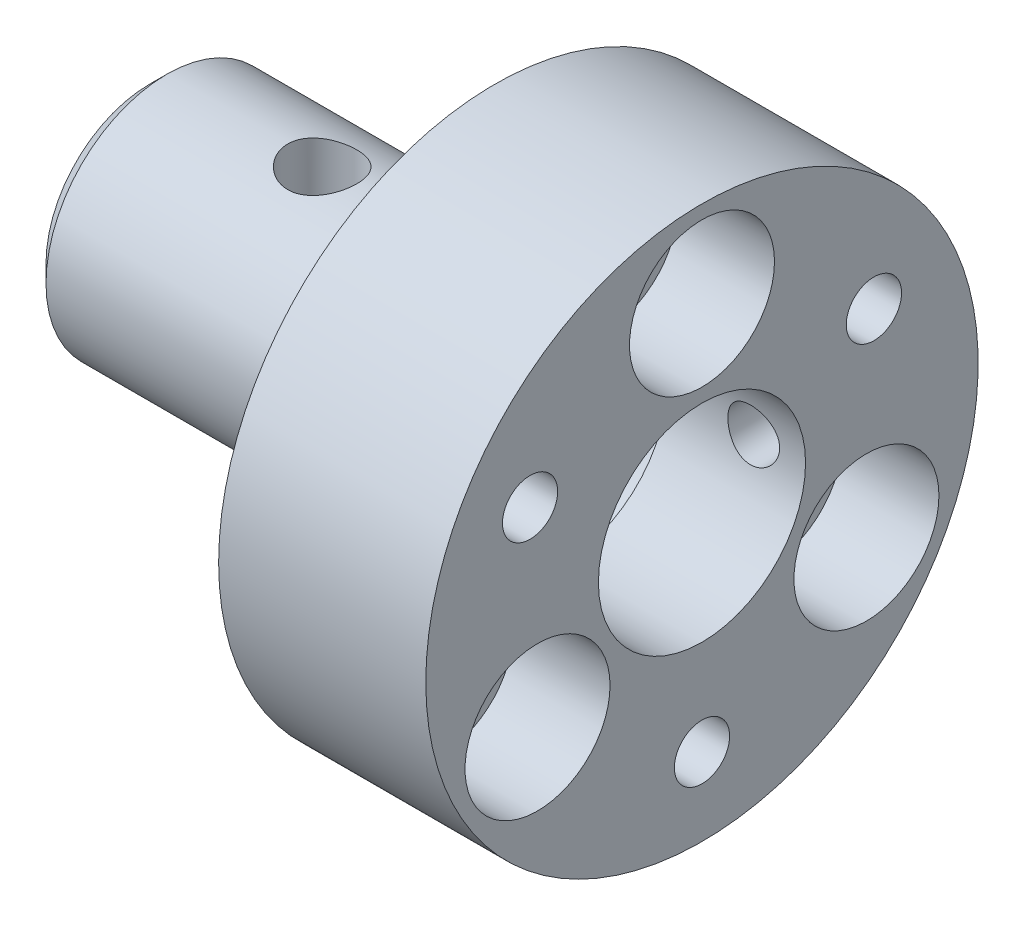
ISO-10303-21;
HEADER;
FILE_DESCRIPTION(('STEP AP214'),'2;1');
FILE_NAME('part.step','',(''),(''),'','','');
FILE_SCHEMA(('AUTOMOTIVE_DESIGN { 1 0 10303 214 1 1 1 1 }'));
ENDSEC;
DATA;
#1=APPLICATION_CONTEXT('core data for automotive mechanical design processes');
#2=APPLICATION_PROTOCOL_DEFINITION('international standard','automotive_design',2000,#1);
#3=PRODUCT_CONTEXT('',#1,'mechanical');
#4=PRODUCT('Part','Part','',(#3));
#5=PRODUCT_RELATED_PRODUCT_CATEGORY('part','',(#4));
#6=PRODUCT_DEFINITION_FORMATION('','',#4);
#7=PRODUCT_DEFINITION_CONTEXT('part definition',#1,'design');
#8=PRODUCT_DEFINITION('design','',#6,#7);
#9=PRODUCT_DEFINITION_SHAPE('','',#8);
#10=(LENGTH_UNIT() NAMED_UNIT(*) SI_UNIT(.MILLI.,.METRE.));
#11=(NAMED_UNIT(*) PLANE_ANGLE_UNIT() SI_UNIT($,.RADIAN.));
#12=(NAMED_UNIT(*) SI_UNIT($,.STERADIAN.) SOLID_ANGLE_UNIT());
#13=UNCERTAINTY_MEASURE_WITH_UNIT(LENGTH_MEASURE(1.E-05),#10,'distance_accuracy_value','');
#14=(GEOMETRIC_REPRESENTATION_CONTEXT(3) GLOBAL_UNCERTAINTY_ASSIGNED_CONTEXT((#13)) GLOBAL_UNIT_ASSIGNED_CONTEXT((#10,
#11,#12)) REPRESENTATION_CONTEXT('',''));
#15=CARTESIAN_POINT('',(0.,0.,0.));
#16=DIRECTION('',(0.,0.,1.));
#17=DIRECTION('',(1.,0.,0.));
#18=AXIS2_PLACEMENT_3D('',#15,#16,#17);
#19=CARTESIAN_POINT('',(58.7146704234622,3.49999999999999,0.));
#20=DIRECTION('',(1.,0.,0.));
#21=DIRECTION('',(0.,0.,-1.));
#22=AXIS2_PLACEMENT_3D('',#19,#20,#21);
#23=PLANE('',#22);
#24=CARTESIAN_POINT('',(58.7146704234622,0.,0.));
#25=DIRECTION('',(-1.,0.,0.));
#26=DIRECTION('',(0.,0.,1.));
#27=AXIS2_PLACEMENT_3D('',#24,#25,#26);
#28=CIRCLE('',#27,3.49999999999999);
#29=CARTESIAN_POINT('',(58.7146704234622,0.,3.49999999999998));
#30=VERTEX_POINT('',#29);
#31=EDGE_CURVE('E50',#30,#30,#28,.T.);
#32=ORIENTED_EDGE('',*,*,#31,.F.);
#33=EDGE_LOOP('',(#32));
#34=FACE_BOUND('',#33,.T.);
#35=CARTESIAN_POINT('',(58.7146704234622,0.,0.));
#36=DIRECTION('',(-1.,0.,0.));
#37=DIRECTION('',(0.,0.,1.));
#38=AXIS2_PLACEMENT_3D('',#35,#36,#37);
#39=CIRCLE('',#38,3.75);
#40=CARTESIAN_POINT('',(58.7146704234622,0.,3.74999999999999));
#41=VERTEX_POINT('',#40);
#42=EDGE_CURVE('E153',#41,#41,#39,.T.);
#43=ORIENTED_EDGE('',*,*,#42,.T.);
#44=EDGE_LOOP('',(#43));
#45=FACE_BOUND('',#44,.T.);
#46=ADVANCED_FACE('F33',(#34,#45),#23,.F.);
#47=CARTESIAN_POINT('',(51.6146704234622,2.19999999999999,0.));
#48=DIRECTION('',(1.,0.,0.));
#49=DIRECTION('',(0.,0.,-1.));
#50=AXIS2_PLACEMENT_3D('',#47,#48,#49);
#51=PLANE('',#50);
#52=CARTESIAN_POINT('',(51.6146704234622,0.,0.));
#53=DIRECTION('',(-1.,0.,0.));
#54=DIRECTION('',(0.,0.,1.));
#55=AXIS2_PLACEMENT_3D('',#52,#53,#54);
#56=CIRCLE('',#55,2.19999999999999);
#57=CARTESIAN_POINT('',(51.6146704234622,0.,2.19999999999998));
#58=VERTEX_POINT('',#57);
#59=EDGE_CURVE('E57',#58,#58,#56,.T.);
#60=ORIENTED_EDGE('',*,*,#59,.F.);
#61=EDGE_LOOP('',(#60));
#62=FACE_BOUND('',#61,.T.);
#63=CARTESIAN_POINT('',(51.6146704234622,0.,0.));
#64=DIRECTION('',(-1.,0.,0.));
#65=DIRECTION('',(0.,0.,1.));
#66=AXIS2_PLACEMENT_3D('',#63,#64,#65);
#67=CIRCLE('',#66,2.99999999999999);
#68=CARTESIAN_POINT('',(51.6146704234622,0.,2.99999999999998));
#69=VERTEX_POINT('',#68);
#70=EDGE_CURVE('E11',#69,#69,#67,.T.);
#71=ORIENTED_EDGE('',*,*,#70,.T.);
#72=EDGE_LOOP('',(#71));
#73=FACE_BOUND('',#72,.T.);
#74=ADVANCED_FACE('F35',(#62,#73),#51,.F.);
#75=CARTESIAN_POINT('',(52.1146704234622,0.,0.));
#76=DIRECTION('',(1.,0.,0.));
#77=DIRECTION('',(0.,0.,-1.));
#78=AXIS2_PLACEMENT_3D('',#75,#76,#77);
#79=CONICAL_SURFACE('',#78,3.49999999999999,0.78539816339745);
#80=ORIENTED_EDGE('',*,*,#70,.F.);
#81=EDGE_LOOP('',(#80));
#82=FACE_BOUND('',#81,.T.);
#83=CARTESIAN_POINT('',(52.1146704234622,0.,0.));
#84=DIRECTION('',(-1.,0.,0.));
#85=DIRECTION('',(0.,0.,1.));
#86=AXIS2_PLACEMENT_3D('',#83,#84,#85);
#87=CIRCLE('',#86,3.49999999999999);
#88=CARTESIAN_POINT('',(52.1146704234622,0.,3.49999999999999));
#89=VERTEX_POINT('',#88);
#90=EDGE_CURVE('E45',#89,#89,#87,.T.);
#91=ORIENTED_EDGE('',*,*,#90,.T.);
#92=EDGE_LOOP('',(#91));
#93=FACE_BOUND('',#92,.T.);
#94=ADVANCED_FACE('F142',(#82,#93),#79,.T.);
#95=CARTESIAN_POINT('',(0.,0.,0.));
#96=DIRECTION('',(-1.,0.,0.));
#97=DIRECTION('',(0.,0.,1.));
#98=AXIS2_PLACEMENT_3D('',#95,#96,#97);
#99=CYLINDRICAL_SURFACE('',#98,3.49999999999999);
#100=CARTESIAN_POINT('',(56.6146704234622,-3.35410196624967,0.999999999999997));
#101=CARTESIAN_POINT('',(56.6695961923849,-3.35410273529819,0.999999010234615));
#102=CARTESIAN_POINT('',(56.7245319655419,-3.35546589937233,0.995459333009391));
#103=CARTESIAN_POINT('',(56.8328060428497,-3.36075194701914,0.977461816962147));
#104=CARTESIAN_POINT('',(56.8861436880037,-3.3646758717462,0.964000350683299));
#105=CARTESIAN_POINT('',(56.9896390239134,-3.37460354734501,0.928646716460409));
#106=CARTESIAN_POINT('',(57.0398014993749,-3.38060407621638,0.906767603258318));
#107=CARTESIAN_POINT('',(57.1357543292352,-3.39400460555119,0.855241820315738));
#108=CARTESIAN_POINT('',(57.1815441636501,-3.40140477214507,0.825594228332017));
#109=CARTESIAN_POINT('',(57.2687662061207,-3.41700891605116,0.758462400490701));
#110=CARTESIAN_POINT('',(57.3100543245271,-3.42522877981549,0.72079460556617));
#111=CARTESIAN_POINT('',(57.3858218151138,-3.44140982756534,0.639085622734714));
#112=CARTESIAN_POINT('',(57.4203003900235,-3.44937098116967,0.595043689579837));
#113=CARTESIAN_POINT('',(57.482084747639,-3.46431666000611,0.500823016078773));
#114=CARTESIAN_POINT('',(57.5092452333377,-3.47128027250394,0.450545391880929));
#115=CARTESIAN_POINT('',(57.5546713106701,-3.48326270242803,0.345904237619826));
#116=CARTESIAN_POINT('',(57.5729386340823,-3.48828189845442,0.291541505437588));
#117=CARTESIAN_POINT('',(57.599587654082,-3.49569759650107,0.181779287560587));
#118=CARTESIAN_POINT('',(57.6082149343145,-3.49815913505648,0.126443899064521));
#119=CARTESIAN_POINT('',(57.6161137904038,-3.50041047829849,0.0150600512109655));
#120=CARTESIAN_POINT('',(57.6153871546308,-3.50020079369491,-0.0409882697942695));
#121=CARTESIAN_POINT('',(57.6047672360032,-3.49718003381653,-0.150490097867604));
#122=CARTESIAN_POINT('',(57.5951396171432,-3.49444435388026,-0.203971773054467));
#123=CARTESIAN_POINT('',(57.56742287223,-3.48676943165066,-0.308526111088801));
#124=CARTESIAN_POINT('',(57.5493332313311,-3.48183005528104,-0.359598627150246));
#125=CARTESIAN_POINT('',(57.5050157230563,-3.47019515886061,-0.458536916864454));
#126=CARTESIAN_POINT('',(57.478701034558,-3.46348102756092,-0.50636152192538));
#127=CARTESIAN_POINT('',(57.4187481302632,-3.44901384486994,-0.597003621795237));
#128=CARTESIAN_POINT('',(57.3851083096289,-3.44126056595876,-0.639820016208));
#129=CARTESIAN_POINT('',(57.3100675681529,-3.42522841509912,-0.720816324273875));
#130=CARTESIAN_POINT('',(57.2684357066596,-3.41694064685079,-0.758780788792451));
#131=CARTESIAN_POINT('',(57.1793128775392,-3.40101486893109,-0.827246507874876));
#132=CARTESIAN_POINT('',(57.1318214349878,-3.3933769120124,-0.857747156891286));
#133=CARTESIAN_POINT('',(57.0318049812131,-3.37957587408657,-0.910616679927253));
#134=CARTESIAN_POINT('',(56.9792428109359,-3.37342505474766,-0.932918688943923));
#135=CARTESIAN_POINT('',(56.8708938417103,-3.36344272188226,-0.968294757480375));
#136=CARTESIAN_POINT('',(56.8151079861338,-3.35961053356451,-0.981371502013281));
#137=CARTESIAN_POINT('',(56.7039302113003,-3.35484557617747,-0.997537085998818));
#138=CARTESIAN_POINT('',(56.6485895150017,-3.35381855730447,-1.00095074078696));
#139=CARTESIAN_POINT('',(56.5381262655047,-3.35452079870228,-0.998594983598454));
#140=CARTESIAN_POINT('',(56.4830036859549,-3.35624971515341,-0.992826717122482));
#141=CARTESIAN_POINT('',(56.3758498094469,-3.3621771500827,-0.972558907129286));
#142=CARTESIAN_POINT('',(56.3237766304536,-3.36631821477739,-0.958262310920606));
#143=CARTESIAN_POINT('',(56.2227694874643,-3.37654531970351,-0.921575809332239));
#144=CARTESIAN_POINT('',(56.1738359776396,-3.38263164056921,-0.899184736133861));
#145=CARTESIAN_POINT('',(56.0791593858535,-3.39625094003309,-0.846309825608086));
#146=CARTESIAN_POINT('',(56.033525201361,-3.40381598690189,-0.815639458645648));
#147=CARTESIAN_POINT('',(55.9479322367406,-3.41946863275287,-0.747302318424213));
#148=CARTESIAN_POINT('',(55.9079746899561,-3.42755634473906,-0.709634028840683));
#149=CARTESIAN_POINT('',(55.8334807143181,-3.44367363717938,-0.626854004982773));
#150=CARTESIAN_POINT('',(55.7991729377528,-3.45169203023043,-0.581533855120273));
#151=CARTESIAN_POINT('',(55.7386475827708,-3.46648988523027,-0.485592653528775));
#152=CARTESIAN_POINT('',(55.712429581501,-3.47326941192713,-0.434971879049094));
#153=CARTESIAN_POINT('',(55.669078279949,-3.48478252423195,-0.330216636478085));
#154=CARTESIAN_POINT('',(55.6518762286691,-3.48953154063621,-0.27611239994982));
#155=CARTESIAN_POINT('',(55.6268570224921,-3.49651669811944,-0.165622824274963));
#156=CARTESIAN_POINT('',(55.6190374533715,-3.49875348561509,-0.109238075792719));
#157=CARTESIAN_POINT('',(55.6131747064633,-3.50042667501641,0.00208911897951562));
#158=CARTESIAN_POINT('',(55.6147983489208,-3.49995851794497,0.0570128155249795));
#159=CARTESIAN_POINT('',(55.6269895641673,-3.49649534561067,0.165772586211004));
#160=CARTESIAN_POINT('',(55.6375567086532,-3.49350045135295,0.219608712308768));
#161=CARTESIAN_POINT('',(55.6671361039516,-3.48534400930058,0.324202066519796));
#162=CARTESIAN_POINT('',(55.6860720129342,-3.48020207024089,0.374982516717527));
#163=CARTESIAN_POINT('',(55.7317835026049,-3.46828547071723,0.472673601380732));
#164=CARTESIAN_POINT('',(55.7585602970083,-3.46151055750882,0.519583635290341));
#165=CARTESIAN_POINT('',(55.8201190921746,-3.44679477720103,0.609716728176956));
#166=CARTESIAN_POINT('',(55.8551154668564,-3.43882522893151,0.652788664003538));
#167=CARTESIAN_POINT('',(55.9317249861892,-3.42272032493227,0.732560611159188));
#168=CARTESIAN_POINT('',(55.9733399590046,-3.41458492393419,0.769258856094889));
#169=CARTESIAN_POINT('',(56.0633188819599,-3.39882018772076,0.836204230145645));
#170=CARTESIAN_POINT('',(56.1118313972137,-3.39120975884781,0.866256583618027));
#171=CARTESIAN_POINT('',(56.2134313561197,-3.37764222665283,0.91773971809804));
#172=CARTESIAN_POINT('',(56.266516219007,-3.37168419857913,0.939175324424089));
#173=CARTESIAN_POINT('',(56.3684972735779,-3.36279229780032,0.970492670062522));
#174=CARTESIAN_POINT('',(56.4170155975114,-3.35956219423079,0.981529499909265));
#175=CARTESIAN_POINT('',(56.5152434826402,-3.35521684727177,0.996283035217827));
#176=CARTESIAN_POINT('',(56.5649528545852,-3.35410127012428,1.00000089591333));
#177=CARTESIAN_POINT('',(56.6146704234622,-3.35410196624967,0.999999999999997));
#178=B_SPLINE_CURVE_WITH_KNOTS('',3,(#100,#101,#102,#103,#104,#105,#106,#107,#108,#109,#110,
#111,#112,#113,#114,#115,#116,#117,#118,#119,#120,#121,#122,#123,#124,#125,#126,#127,#128,#129,
#130,#131,#132,#133,#134,#135,#136,#137,#138,#139,#140,#141,#142,#143,#144,#145,#146,#147,#148,
#149,#150,#151,#152,#153,#154,#155,#156,#157,#158,#159,#160,#161,#162,#163,#164,#165,#166,#167,
#168,#169,#170,#171,#172,#173,#174,#175,#176,#177),.UNSPECIFIED.,.T.,.F.,(4,2,2,2,2,2,2,2,2,2,2,
2,2,2,2,2,2,2,2,2,2,2,2,2,2,2,2,2,2,2,2,2,2,2,2,2,2,2,4),(0.,0.164594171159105,0.32925530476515,
0.493662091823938,0.658088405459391,0.826785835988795,0.995503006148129,1.16735741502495,
1.33917834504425,1.50651450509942,1.6738186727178,1.83628518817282,1.99876158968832,
2.16301451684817,2.32730346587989,2.49735806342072,2.66742645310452,2.83885260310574,
3.01022883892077,3.17577181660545,3.34129414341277,3.50302644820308,3.66478209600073,
3.83054003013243,3.99633392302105,4.16772694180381,4.33911100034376,4.50916842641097,
4.67918208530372,4.84323448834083,5.0072790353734,5.16985706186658,5.33246026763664,
5.49989884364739,5.6673837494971,5.83926806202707,6.01105598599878,6.160066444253,
6.30905338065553),.UNSPECIFIED.);
#179=CARTESIAN_POINT('',(56.6146704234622,-3.35410196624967,0.999999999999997));
#180=VERTEX_POINT('',#179);
#181=EDGE_CURVE('E80',#180,#180,#178,.T.);
#182=ORIENTED_EDGE('',*,*,#181,.T.);
#183=EDGE_LOOP('',(#182));
#184=FACE_BOUND('',#183,.T.);
#185=CARTESIAN_POINT('',(56.6146704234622,3.35410196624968,0.999999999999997));
#186=CARTESIAN_POINT('',(56.5597446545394,3.35410273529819,0.999999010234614));
#187=CARTESIAN_POINT('',(56.5048088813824,3.35546589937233,0.995459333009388));
#188=CARTESIAN_POINT('',(56.3965348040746,3.36075194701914,0.977461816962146));
#189=CARTESIAN_POINT('',(56.3431971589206,3.36467587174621,0.9640003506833));
#190=CARTESIAN_POINT('',(56.239701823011,3.37460354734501,0.928646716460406));
#191=CARTESIAN_POINT('',(56.1895393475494,3.38060407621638,0.906767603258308));
#192=CARTESIAN_POINT('',(56.0935865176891,3.39400460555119,0.85524182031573));
#193=CARTESIAN_POINT('',(56.0477966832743,3.40140477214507,0.825594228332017));
#194=CARTESIAN_POINT('',(55.9605746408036,3.41700891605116,0.758462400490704));
#195=CARTESIAN_POINT('',(55.9192865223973,3.42522877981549,0.720794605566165));
#196=CARTESIAN_POINT('',(55.8435190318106,3.44140982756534,0.639085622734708));
#197=CARTESIAN_POINT('',(55.8090404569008,3.44937098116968,0.595043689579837));
#198=CARTESIAN_POINT('',(55.7472560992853,3.46431666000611,0.500823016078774));
#199=CARTESIAN_POINT('',(55.7200956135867,3.47128027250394,0.450545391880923));
#200=CARTESIAN_POINT('',(55.6746695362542,3.48326270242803,0.34590423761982));
#201=CARTESIAN_POINT('',(55.656402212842,3.48828189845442,0.291541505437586));
#202=CARTESIAN_POINT('',(55.6297531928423,3.49569759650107,0.181779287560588));
#203=CARTESIAN_POINT('',(55.6211259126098,3.49815913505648,0.126443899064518));
#204=CARTESIAN_POINT('',(55.6132270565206,3.50041047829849,0.0150600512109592));
#205=CARTESIAN_POINT('',(55.6139536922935,3.50020079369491,-0.0409882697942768));
#206=CARTESIAN_POINT('',(55.6245736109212,3.49718003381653,-0.15049009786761));
#207=CARTESIAN_POINT('',(55.6342012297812,3.49444435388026,-0.203971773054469));
#208=CARTESIAN_POINT('',(55.6619179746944,3.48676943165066,-0.308526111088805));
#209=CARTESIAN_POINT('',(55.6800076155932,3.48183005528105,-0.359598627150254));
#210=CARTESIAN_POINT('',(55.7243251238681,3.47019515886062,-0.45853691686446));
#211=CARTESIAN_POINT('',(55.7506398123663,3.46348102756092,-0.506361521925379));
#212=CARTESIAN_POINT('',(55.8105927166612,3.44901384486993,-0.597003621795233));
#213=CARTESIAN_POINT('',(55.8442325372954,3.44126056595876,-0.639820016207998));
#214=CARTESIAN_POINT('',(55.9192732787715,3.42522841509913,-0.720816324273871));
#215=CARTESIAN_POINT('',(55.9609051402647,3.41694064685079,-0.758780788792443));
#216=CARTESIAN_POINT('',(56.0500279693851,3.40101486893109,-0.827246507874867));
#217=CARTESIAN_POINT('',(56.0975194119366,3.3933769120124,-0.857747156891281));
#218=CARTESIAN_POINT('',(56.1975358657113,3.37957587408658,-0.910616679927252));
#219=CARTESIAN_POINT('',(56.2500980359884,3.37342505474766,-0.93291868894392));
#220=CARTESIAN_POINT('',(56.358447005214,3.36344272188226,-0.968294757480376));
#221=CARTESIAN_POINT('',(56.4142328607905,3.35961053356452,-0.981371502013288));
#222=CARTESIAN_POINT('',(56.525410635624,3.35484557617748,-0.997537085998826));
#223=CARTESIAN_POINT('',(56.5807513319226,3.35381855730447,-1.00095074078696));
#224=CARTESIAN_POINT('',(56.6912145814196,3.35452079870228,-0.998594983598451));
#225=CARTESIAN_POINT('',(56.7463371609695,3.35624971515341,-0.992826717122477));
#226=CARTESIAN_POINT('',(56.8534910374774,3.36217715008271,-0.972558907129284));
#227=CARTESIAN_POINT('',(56.9055642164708,3.36631821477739,-0.95826231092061));
#228=CARTESIAN_POINT('',(57.00657135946,3.37654531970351,-0.921575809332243));
#229=CARTESIAN_POINT('',(57.0555048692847,3.38263164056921,-0.89918473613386));
#230=CARTESIAN_POINT('',(57.1501814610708,3.3962509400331,-0.846309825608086));
#231=CARTESIAN_POINT('',(57.1958156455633,3.40381598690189,-0.815639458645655));
#232=CARTESIAN_POINT('',(57.2814086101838,3.41946863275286,-0.74730231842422));
#233=CARTESIAN_POINT('',(57.3213661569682,3.42755634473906,-0.709634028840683));
#234=CARTESIAN_POINT('',(57.3958601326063,3.44367363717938,-0.626854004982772));
#235=CARTESIAN_POINT('',(57.4301679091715,3.45169203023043,-0.581533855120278));
#236=CARTESIAN_POINT('',(57.4906932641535,3.46648988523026,-0.485592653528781));
#237=CARTESIAN_POINT('',(57.5169112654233,3.47326941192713,-0.434971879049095));
#238=CARTESIAN_POINT('',(57.5602625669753,3.48478252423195,-0.330216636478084));
#239=CARTESIAN_POINT('',(57.5774646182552,3.48953154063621,-0.276112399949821));
#240=CARTESIAN_POINT('',(57.6024838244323,3.49651669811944,-0.165622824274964));
#241=CARTESIAN_POINT('',(57.6103033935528,3.49875348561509,-0.109238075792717));
#242=CARTESIAN_POINT('',(57.6161661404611,3.50042667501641,0.00208911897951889));
#243=CARTESIAN_POINT('',(57.6145424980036,3.49995851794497,0.0570128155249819));
#244=CARTESIAN_POINT('',(57.602351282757,3.49649534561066,0.165772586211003));
#245=CARTESIAN_POINT('',(57.5917841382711,3.49350045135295,0.219608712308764));
#246=CARTESIAN_POINT('',(57.5622047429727,3.48534400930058,0.324202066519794));
#247=CARTESIAN_POINT('',(57.5432688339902,3.48020207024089,0.37498251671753));
#248=CARTESIAN_POINT('',(57.4975573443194,3.46828547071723,0.472673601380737));
#249=CARTESIAN_POINT('',(57.470780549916,3.46151055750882,0.519583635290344));
#250=CARTESIAN_POINT('',(57.4092217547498,3.44679477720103,0.609716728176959));
#251=CARTESIAN_POINT('',(57.374225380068,3.43882522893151,0.652788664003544));
#252=CARTESIAN_POINT('',(57.2976158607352,3.42272032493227,0.732560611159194));
#253=CARTESIAN_POINT('',(57.2560008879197,3.41458492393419,0.769258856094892));
#254=CARTESIAN_POINT('',(57.1660219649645,3.39882018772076,0.836204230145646));
#255=CARTESIAN_POINT('',(57.1175094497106,3.3912097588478,0.866256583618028));
#256=CARTESIAN_POINT('',(57.0159094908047,3.37764222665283,0.917739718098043));
#257=CARTESIAN_POINT('',(56.9628246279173,3.37168419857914,0.939175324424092));
#258=CARTESIAN_POINT('',(56.8608435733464,3.36279229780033,0.970492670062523));
#259=CARTESIAN_POINT('',(56.8123252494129,3.35956219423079,0.981529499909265));
#260=CARTESIAN_POINT('',(56.7140973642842,3.35521684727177,0.996283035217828));
#261=CARTESIAN_POINT('',(56.6643879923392,3.35410127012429,1.00000089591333));
#262=CARTESIAN_POINT('',(56.6146704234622,3.35410196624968,0.999999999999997));
#263=B_SPLINE_CURVE_WITH_KNOTS('',3,(#185,#186,#187,#188,#189,#190,#191,#192,#193,#194,#195,
#196,#197,#198,#199,#200,#201,#202,#203,#204,#205,#206,#207,#208,#209,#210,#211,#212,#213,#214,
#215,#216,#217,#218,#219,#220,#221,#222,#223,#224,#225,#226,#227,#228,#229,#230,#231,#232,#233,
#234,#235,#236,#237,#238,#239,#240,#241,#242,#243,#244,#245,#246,#247,#248,#249,#250,#251,#252,
#253,#254,#255,#256,#257,#258,#259,#260,#261,#262),.UNSPECIFIED.,.T.,.F.,(4,2,2,2,2,2,2,2,2,2,2,
2,2,2,2,2,2,2,2,2,2,2,2,2,2,2,2,2,2,2,2,2,2,2,2,2,2,2,4),(0.,0.164594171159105,
0.329255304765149,0.493662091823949,0.658088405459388,0.826785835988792,0.995503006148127,
1.16735741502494,1.33917834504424,1.50651450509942,1.6738186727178,1.83628518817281,
1.99876158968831,2.16301451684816,2.32730346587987,2.4973580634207,2.6674264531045,
2.83885260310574,3.01022883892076,3.17577181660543,3.34129414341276,3.50302644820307,
3.66478209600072,3.83054003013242,3.99633392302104,4.1677269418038,4.33911100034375,
4.50916842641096,4.67918208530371,4.84323448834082,5.00727903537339,5.16985706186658,
5.33246026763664,5.49989884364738,5.6673837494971,5.83926806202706,6.01105598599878,
6.16006644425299,6.30905338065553),.UNSPECIFIED.);
#264=CARTESIAN_POINT('',(56.6146704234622,3.35410196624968,0.999999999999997));
#265=VERTEX_POINT('',#264);
#266=EDGE_CURVE('E145',#265,#265,#263,.T.);
#267=ORIENTED_EDGE('',*,*,#266,.T.);
#268=EDGE_LOOP('',(#267));
#269=FACE_BOUND('',#268,.T.);
#270=ORIENTED_EDGE('',*,*,#90,.F.);
#271=EDGE_LOOP('',(#270));
#272=FACE_BOUND('',#271,.T.);
#273=ORIENTED_EDGE('',*,*,#31,.T.);
#274=EDGE_LOOP('',(#273));
#275=FACE_BOUND('',#274,.T.);
#276=ADVANCED_FACE('F136',(#184,#269,#272,#275),#99,.T.);
#277=CARTESIAN_POINT('',(61.6146704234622,3.89999999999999,0.));
#278=DIRECTION('',(1.,0.,0.));
#279=DIRECTION('',(0.,0.,-1.));
#280=AXIS2_PLACEMENT_3D('',#277,#278,#279);
#281=PLANE('',#280);
#282=CARTESIAN_POINT('',(61.6146704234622,2.87499999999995,-4.97964607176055));
#283=DIRECTION('',(1.,0.,0.));
#284=DIRECTION('',(0.,0.,-1.));
#285=AXIS2_PLACEMENT_3D('',#282,#283,#284);
#286=CIRCLE('',#285,0.799999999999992);
#287=CARTESIAN_POINT('',(61.6146704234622,2.87499999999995,-5.77964607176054));
#288=VERTEX_POINT('',#287);
#289=EDGE_CURVE('E249',#288,#288,#286,.T.);
#290=ORIENTED_EDGE('',*,*,#289,.T.);
#291=EDGE_LOOP('',(#290));
#292=FACE_BOUND('',#291,.T.);
#293=CARTESIAN_POINT('',(61.6146704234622,2.87500000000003,4.97964607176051));
#294=DIRECTION('',(1.,0.,0.));
#295=DIRECTION('',(0.,0.,-1.));
#296=AXIS2_PLACEMENT_3D('',#293,#294,#295);
#297=CIRCLE('',#296,0.799999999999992);
#298=CARTESIAN_POINT('',(61.6146704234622,2.87500000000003,4.17964607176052));
#299=VERTEX_POINT('',#298);
#300=EDGE_CURVE('E243',#299,#299,#297,.T.);
#301=ORIENTED_EDGE('',*,*,#300,.T.);
#302=EDGE_LOOP('',(#301));
#303=FACE_BOUND('',#302,.T.);
#304=CARTESIAN_POINT('',(61.6146704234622,-2.74999999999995,4.76313972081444));
#305=DIRECTION('',(1.,0.,0.));
#306=DIRECTION('',(0.,0.,-1.));
#307=AXIS2_PLACEMENT_3D('',#304,#305,#306);
#308=CIRCLE('',#307,1.1);
#309=CARTESIAN_POINT('',(61.6146704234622,-2.74999999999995,3.66313972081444));
#310=VERTEX_POINT('',#309);
#311=EDGE_CURVE('E68',#310,#310,#308,.T.);
#312=ORIENTED_EDGE('',*,*,#311,.T.);
#313=EDGE_LOOP('',(#312));
#314=FACE_BOUND('',#313,.T.);
#315=CARTESIAN_POINT('',(61.6146704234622,-2.75000000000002,-4.7631397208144));
#316=DIRECTION('',(1.,0.,0.));
#317=DIRECTION('',(0.,0.,-1.));
#318=AXIS2_PLACEMENT_3D('',#315,#316,#317);
#319=CIRCLE('',#318,1.1);
#320=CARTESIAN_POINT('',(61.6146704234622,-2.75000000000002,-5.8631397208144));
#321=VERTEX_POINT('',#320);
#322=EDGE_CURVE('E64',#321,#321,#319,.T.);
#323=ORIENTED_EDGE('',*,*,#322,.T.);
#324=EDGE_LOOP('',(#323));
#325=FACE_BOUND('',#324,.T.);
#326=CARTESIAN_POINT('',(61.6146704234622,-5.74999999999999,0.));
#327=DIRECTION('',(1.,0.,0.));
#328=DIRECTION('',(0.,0.,-1.));
#329=AXIS2_PLACEMENT_3D('',#326,#327,#328);
#330=CIRCLE('',#329,0.799999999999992);
#331=CARTESIAN_POINT('',(61.6146704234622,-5.74999999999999,-0.799999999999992));
#332=VERTEX_POINT('',#331);
#333=EDGE_CURVE('E59',#332,#332,#330,.T.);
#334=ORIENTED_EDGE('',*,*,#333,.T.);
#335=EDGE_LOOP('',(#334));
#336=FACE_BOUND('',#335,.T.);
#337=CARTESIAN_POINT('',(61.6146704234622,5.5,0.));
#338=DIRECTION('',(1.,0.,0.));
#339=DIRECTION('',(0.,0.,-1.));
#340=AXIS2_PLACEMENT_3D('',#337,#338,#339);
#341=CIRCLE('',#340,1.1);
#342=CARTESIAN_POINT('',(61.6146704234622,5.5,-1.1));
#343=VERTEX_POINT('',#342);
#344=EDGE_CURVE('E54',#343,#343,#341,.T.);
#345=ORIENTED_EDGE('',*,*,#344,.T.);
#346=EDGE_LOOP('',(#345));
#347=FACE_BOUND('',#346,.T.);
#348=CARTESIAN_POINT('',(61.6146704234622,0.,0.));
#349=DIRECTION('',(-1.,0.,0.));
#350=DIRECTION('',(0.,0.,1.));
#351=AXIS2_PLACEMENT_3D('',#348,#349,#350);
#352=CIRCLE('',#351,7.99999999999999);
#353=CARTESIAN_POINT('',(61.6146704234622,0.,7.99999999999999));
#354=VERTEX_POINT('',#353);
#355=EDGE_CURVE('E183',#354,#354,#352,.T.);
#356=ORIENTED_EDGE('',*,*,#355,.T.);
#357=EDGE_LOOP('',(#356));
#358=FACE_BOUND('',#357,.T.);
#359=CARTESIAN_POINT('',(61.6146704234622,0.,0.));
#360=DIRECTION('',(1.,0.,0.));
#361=DIRECTION('',(0.,0.,-1.));
#362=AXIS2_PLACEMENT_3D('',#359,#360,#361);
#363=CIRCLE('',#362,3.75);
#364=CARTESIAN_POINT('',(61.6146704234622,0.,-3.75));
#365=VERTEX_POINT('',#364);
#366=EDGE_CURVE('E150',#365,#365,#363,.F.);
#367=ORIENTED_EDGE('',*,*,#366,.F.);
#368=EDGE_LOOP('',(#367));
#369=FACE_BOUND('',#368,.T.);
#370=ADVANCED_FACE('F132',(#292,#303,#314,#325,#336,#347,#358,#369),#281,.F.);
#371=CARTESIAN_POINT('',(0.,0.,0.));
#372=DIRECTION('',(-1.,0.,0.));
#373=DIRECTION('',(0.,0.,1.));
#374=AXIS2_PLACEMENT_3D('',#371,#372,#373);
#375=CYLINDRICAL_SURFACE('',#374,7.99999999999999);
#376=CARTESIAN_POINT('',(66.8646704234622,0.,-7.99999999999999));
#377=CARTESIAN_POINT('',(66.8646685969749,0.0420288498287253,-7.99999954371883));
#378=CARTESIAN_POINT('',(66.8611256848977,0.0840858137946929,-7.9996652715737));
#379=CARTESIAN_POINT('',(66.8470452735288,0.167034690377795,-7.99836393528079));
#380=CARTESIAN_POINT('',(66.8364999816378,0.207925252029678,-7.99739616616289));
#381=CARTESIAN_POINT('',(66.808723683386,0.28732806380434,-7.99493712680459));
#382=CARTESIAN_POINT('',(66.7914966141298,0.325841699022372,-7.99344616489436));
#383=CARTESIAN_POINT('',(66.7508531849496,0.399422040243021,-7.99010764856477));
#384=CARTESIAN_POINT('',(66.7274380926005,0.434489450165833,-7.98826016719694));
#385=CARTESIAN_POINT('',(66.6750031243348,0.500302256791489,-7.98440913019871));
#386=CARTESIAN_POINT('',(66.6459675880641,0.531035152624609,-7.9824051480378));
#387=CARTESIAN_POINT('',(66.5831492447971,0.587199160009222,-7.97847051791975));
#388=CARTESIAN_POINT('',(66.5493662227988,0.612630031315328,-7.97653987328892));
#389=CARTESIAN_POINT('',(66.4779345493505,0.657511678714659,-7.97296607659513));
#390=CARTESIAN_POINT('',(66.4402788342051,0.676951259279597,-7.97132346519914));
#391=CARTESIAN_POINT('',(66.3622197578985,0.709227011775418,-7.96851686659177));
#392=CARTESIAN_POINT('',(66.3218164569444,0.722063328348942,-7.9673528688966));
#393=CARTESIAN_POINT('',(66.2395358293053,0.740731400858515,-7.96563905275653));
#394=CARTESIAN_POINT('',(66.1976632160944,0.746583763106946,-7.96508742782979));
#395=CARTESIAN_POINT('',(66.113526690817,0.751181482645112,-7.96465517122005));
#396=CARTESIAN_POINT('',(66.0712627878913,0.749927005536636,-7.96477452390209));
#397=CARTESIAN_POINT('',(65.9876851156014,0.740363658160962,-7.96566909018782));
#398=CARTESIAN_POINT('',(65.9463687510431,0.732077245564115,-7.96644221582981));
#399=CARTESIAN_POINT('',(65.8657158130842,0.708720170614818,-7.96855395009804));
#400=CARTESIAN_POINT('',(65.8263792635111,0.693649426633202,-7.96989256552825));
#401=CARTESIAN_POINT('',(65.7507313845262,0.657126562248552,-7.97298685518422));
#402=CARTESIAN_POINT('',(65.714424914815,0.635664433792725,-7.97474318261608));
#403=CARTESIAN_POINT('',(65.6459209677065,0.586975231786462,-7.9784744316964));
#404=CARTESIAN_POINT('',(65.6137235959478,0.559748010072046,-7.98044935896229));
#405=CARTESIAN_POINT('',(65.5542212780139,0.500175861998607,-7.98440458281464));
#406=CARTESIAN_POINT('',(65.5269357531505,0.467811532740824,-7.98638487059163));
#407=CARTESIAN_POINT('',(65.478182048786,0.398951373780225,-7.99012044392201));
#408=CARTESIAN_POINT('',(65.45671387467,0.362455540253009,-7.9918757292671));
#409=CARTESIAN_POINT('',(65.4202052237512,0.286355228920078,-7.99496400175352));
#410=CARTESIAN_POINT('',(65.4051656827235,0.246750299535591,-7.99629692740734));
#411=CARTESIAN_POINT('',(65.3819551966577,0.165562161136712,-7.99838964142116));
#412=CARTESIAN_POINT('',(65.3737840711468,0.123979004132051,-7.99914944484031));
#413=CARTESIAN_POINT('',(65.3645668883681,0.0401830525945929,-8.00000837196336));
#414=CARTESIAN_POINT('',(65.363494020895,-0.00202676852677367,-8.00010998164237));
#415=CARTESIAN_POINT('',(65.3684334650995,-0.0860256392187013,-7.99964772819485));
#416=CARTESIAN_POINT('',(65.374445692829,-0.127814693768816,-7.99908387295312));
#417=CARTESIAN_POINT('',(65.3933624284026,-0.209708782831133,-7.99735566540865));
#418=CARTESIAN_POINT('',(65.4062544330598,-0.249816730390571,-7.99619240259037));
#419=CARTESIAN_POINT('',(65.4385519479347,-0.327300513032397,-7.99339595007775));
#420=CARTESIAN_POINT('',(65.4579575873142,-0.364676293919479,-7.99176275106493));
#421=CARTESIAN_POINT('',(65.502798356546,-0.435756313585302,-7.98820307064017));
#422=CARTESIAN_POINT('',(65.5282511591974,-0.469449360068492,-7.98627573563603));
#423=CARTESIAN_POINT('',(65.5844383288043,-0.53209431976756,-7.98234694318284));
#424=CARTESIAN_POINT('',(65.6151728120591,-0.561046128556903,-7.98034548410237));
#425=CARTESIAN_POINT('',(65.6811676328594,-0.613479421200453,-7.97648658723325));
#426=CARTESIAN_POINT('',(65.7164419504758,-0.636943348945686,-7.97462962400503));
#427=CARTESIAN_POINT('',(65.7904459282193,-0.677614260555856,-7.9712770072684));
#428=CARTESIAN_POINT('',(65.8291755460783,-0.694821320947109,-7.96978134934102));
#429=CARTESIAN_POINT('',(65.9089297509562,-0.722460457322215,-7.96732354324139));
#430=CARTESIAN_POINT('',(65.9499506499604,-0.732903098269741,-7.96636056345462));
#431=CARTESIAN_POINT('',(66.0331730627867,-0.746751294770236,-7.96507449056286));
#432=CARTESIAN_POINT('',(66.0753745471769,-0.750157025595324,-7.96475138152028));
#433=CARTESIAN_POINT('',(66.1595857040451,-0.749832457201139,-7.96478193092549));
#434=CARTESIAN_POINT('',(66.201595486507,-0.746129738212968,-7.96513297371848));
#435=CARTESIAN_POINT('',(66.2843935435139,-0.731751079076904,-7.96646670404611));
#436=CARTESIAN_POINT('',(66.3251818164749,-0.72107512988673,-7.96744939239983));
#437=CARTESIAN_POINT('',(66.4043795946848,-0.693060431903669,-7.96993497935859));
#438=CARTESIAN_POINT('',(66.442789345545,-0.675722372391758,-7.97143782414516));
#439=CARTESIAN_POINT('',(66.5161577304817,-0.634878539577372,-7.97479449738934));
#440=CARTESIAN_POINT('',(66.5511163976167,-0.61137282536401,-7.97664832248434));
#441=CARTESIAN_POINT('',(66.6167315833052,-0.558757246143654,-7.98050667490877));
#442=CARTESIAN_POINT('',(66.6473716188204,-0.529626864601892,-7.9825117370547));
#443=CARTESIAN_POINT('',(66.7033413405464,-0.466628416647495,-7.98644174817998));
#444=CARTESIAN_POINT('',(66.7286697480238,-0.43275921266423,-7.98836667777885));
#445=CARTESIAN_POINT('',(66.7733408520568,-0.361162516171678,-7.99192394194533));
#446=CARTESIAN_POINT('',(66.7926699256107,-0.323426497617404,-7.99355560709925));
#447=CARTESIAN_POINT('',(66.8246920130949,-0.245253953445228,-7.99633502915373));
#448=CARTESIAN_POINT('',(66.8373925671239,-0.20482055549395,-7.99748333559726));
#449=CARTESIAN_POINT('',(66.8526032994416,-0.136795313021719,-7.99887563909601));
#450=CARTESIAN_POINT('',(66.8571223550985,-0.109639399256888,-7.9992953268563));
#451=CARTESIAN_POINT('',(66.8631565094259,-0.0549930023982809,-7.99985765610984));
#452=CARTESIAN_POINT('',(66.8646716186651,-0.0275025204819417,-8.0000002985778));
#453=CARTESIAN_POINT('',(66.8646704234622,0.,-7.99999999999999));
#454=B_SPLINE_CURVE_WITH_KNOTS('',3,(#376,#377,#378,#379,#380,#381,#382,#383,#384,#385,#386,
#387,#388,#389,#390,#391,#392,#393,#394,#395,#396,#397,#398,#399,#400,#401,#402,#403,#404,#405,
#406,#407,#408,#409,#410,#411,#412,#413,#414,#415,#416,#417,#418,#419,#420,#421,#422,#423,#424,
#425,#426,#427,#428,#429,#430,#431,#432,#433,#434,#435,#436,#437,#438,#439,#440,#441,#442,#443,
#444,#445,#446,#447,#448,#449,#450,#451,#452,#453),.UNSPECIFIED.,.T.,.F.,(4,2,2,2,2,2,2,2,2,2,2,
2,2,2,2,2,2,2,2,2,2,2,2,2,2,2,2,2,2,2,2,2,2,2,2,2,2,2,4),(0.,0.125986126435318,
0.252112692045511,0.378165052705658,0.50419161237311,0.630574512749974,0.756963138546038,
0.883586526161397,1.01020714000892,1.13645322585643,1.26269636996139,1.38853784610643,
1.51438083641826,1.64042192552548,1.76646625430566,1.89299850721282,2.01953087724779,
2.14608165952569,2.27262911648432,2.39869832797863,2.52476604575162,2.65060542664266,
2.77644730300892,2.90266157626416,3.02887862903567,3.155494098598,3.28210801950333,
3.40852370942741,3.53493625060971,3.66085931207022,3.78678253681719,3.91269273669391,
4.03860173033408,4.16497897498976,4.29138660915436,4.41807921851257,4.5446273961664,
4.62706953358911,4.70951138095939),.UNSPECIFIED.);
#455=CARTESIAN_POINT('',(66.8646704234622,0.,-7.99999999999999));
#456=VERTEX_POINT('',#455);
#457=EDGE_CURVE('E108',#456,#456,#454,.T.);
#458=ORIENTED_EDGE('',*,*,#457,.T.);
#459=EDGE_LOOP('',(#458));
#460=FACE_BOUND('',#459,.T.);
#461=ORIENTED_EDGE('',*,*,#355,.F.);
#462=EDGE_LOOP('',(#461));
#463=FACE_BOUND('',#462,.T.);
#464=CARTESIAN_POINT('',(67.6146704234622,0.,0.));
#465=DIRECTION('',(-1.,0.,0.));
#466=DIRECTION('',(0.,0.,1.));
#467=AXIS2_PLACEMENT_3D('',#464,#465,#466);
#468=CIRCLE('',#467,7.99999999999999);
#469=CARTESIAN_POINT('',(67.6146704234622,0.,8.));
#470=VERTEX_POINT('',#469);
#471=EDGE_CURVE('E185',#470,#470,#468,.T.);
#472=ORIENTED_EDGE('',*,*,#471,.T.);
#473=EDGE_LOOP('',(#472));
#474=FACE_BOUND('',#473,.T.);
#475=ADVANCED_FACE('F127',(#460,#463,#474),#375,.T.);
#476=CARTESIAN_POINT('',(67.6146704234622,7.99999999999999,0.));
#477=DIRECTION('',(-1.,0.,0.));
#478=DIRECTION('',(0.,0.,1.));
#479=AXIS2_PLACEMENT_3D('',#476,#477,#478);
#480=PLANE('',#479);
#481=CARTESIAN_POINT('',(67.6146704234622,2.87499999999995,-4.97964607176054));
#482=DIRECTION('',(1.,0.,0.));
#483=DIRECTION('',(0.,0.,-1.));
#484=AXIS2_PLACEMENT_3D('',#481,#482,#483);
#485=CIRCLE('',#484,0.799999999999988);
#486=CARTESIAN_POINT('',(67.6146704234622,2.87499999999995,-5.77964607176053));
#487=VERTEX_POINT('',#486);
#488=EDGE_CURVE('E251',#487,#487,#485,.T.);
#489=ORIENTED_EDGE('',*,*,#488,.F.);
#490=EDGE_LOOP('',(#489));
#491=FACE_BOUND('',#490,.T.);
#492=CARTESIAN_POINT('',(67.6146704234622,2.87500000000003,4.97964607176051));
#493=DIRECTION('',(1.,0.,0.));
#494=DIRECTION('',(0.,0.,-1.));
#495=AXIS2_PLACEMENT_3D('',#492,#493,#494);
#496=CIRCLE('',#495,0.799999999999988);
#497=CARTESIAN_POINT('',(67.6146704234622,2.87500000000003,4.17964607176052));
#498=VERTEX_POINT('',#497);
#499=EDGE_CURVE('E246',#498,#498,#496,.T.);
#500=ORIENTED_EDGE('',*,*,#499,.F.);
#501=EDGE_LOOP('',(#500));
#502=FACE_BOUND('',#501,.T.);
#503=CARTESIAN_POINT('',(67.6146704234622,-2.74999999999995,4.76313972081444));
#504=DIRECTION('',(1.,0.,0.));
#505=DIRECTION('',(0.,0.,-1.));
#506=AXIS2_PLACEMENT_3D('',#503,#504,#505);
#507=CIRCLE('',#506,2.1);
#508=CARTESIAN_POINT('',(67.6146704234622,-2.74999999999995,2.66313972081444));
#509=VERTEX_POINT('',#508);
#510=EDGE_CURVE('E240',#509,#509,#507,.T.);
#511=ORIENTED_EDGE('',*,*,#510,.F.);
#512=EDGE_LOOP('',(#511));
#513=FACE_BOUND('',#512,.T.);
#514=CARTESIAN_POINT('',(67.6146704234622,-2.75000000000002,-4.76313972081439));
#515=DIRECTION('',(1.,0.,0.));
#516=DIRECTION('',(0.,0.,-1.));
#517=AXIS2_PLACEMENT_3D('',#514,#515,#516);
#518=CIRCLE('',#517,2.1);
#519=CARTESIAN_POINT('',(67.6146704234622,-2.75000000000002,-6.86313972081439));
#520=VERTEX_POINT('',#519);
#521=EDGE_CURVE('E71',#520,#520,#518,.T.);
#522=ORIENTED_EDGE('',*,*,#521,.F.);
#523=EDGE_LOOP('',(#522));
#524=FACE_BOUND('',#523,.T.);
#525=CARTESIAN_POINT('',(67.6146704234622,-5.75,0.));
#526=DIRECTION('',(1.,0.,0.));
#527=DIRECTION('',(0.,0.,-1.));
#528=AXIS2_PLACEMENT_3D('',#525,#526,#527);
#529=CIRCLE('',#528,0.799999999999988);
#530=CARTESIAN_POINT('',(67.6146704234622,-5.75,-0.799999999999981));
#531=VERTEX_POINT('',#530);
#532=EDGE_CURVE('E63',#531,#531,#529,.T.);
#533=ORIENTED_EDGE('',*,*,#532,.F.);
#534=EDGE_LOOP('',(#533));
#535=FACE_BOUND('',#534,.T.);
#536=CARTESIAN_POINT('',(67.6146704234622,5.5,0.));
#537=DIRECTION('',(1.,0.,0.));
#538=DIRECTION('',(0.,0.,-1.));
#539=AXIS2_PLACEMENT_3D('',#536,#537,#538);
#540=CIRCLE('',#539,2.1);
#541=CARTESIAN_POINT('',(67.6146704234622,5.5,-2.09999999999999));
#542=VERTEX_POINT('',#541);
#543=EDGE_CURVE('E62',#542,#542,#540,.T.);
#544=ORIENTED_EDGE('',*,*,#543,.F.);
#545=EDGE_LOOP('',(#544));
#546=FACE_BOUND('',#545,.T.);
#547=ORIENTED_EDGE('',*,*,#471,.F.);
#548=EDGE_LOOP('',(#547));
#549=FACE_BOUND('',#548,.T.);
#550=CARTESIAN_POINT('',(67.6146704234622,0.,0.));
#551=DIRECTION('',(-1.,0.,0.));
#552=DIRECTION('',(0.,0.,1.));
#553=AXIS2_PLACEMENT_3D('',#550,#551,#552);
#554=CIRCLE('',#553,2.99999999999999);
#555=CARTESIAN_POINT('',(67.6146704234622,0.,3.));
#556=VERTEX_POINT('',#555);
#557=EDGE_CURVE('E190',#556,#556,#554,.T.);
#558=ORIENTED_EDGE('',*,*,#557,.T.);
#559=EDGE_LOOP('',(#558));
#560=FACE_BOUND('',#559,.T.);
#561=ADVANCED_FACE('F123',(#491,#502,#513,#524,#535,#546,#549,#560),#480,.F.);
#562=CARTESIAN_POINT('',(0.,0.,0.));
#563=DIRECTION('',(-1.,0.,0.));
#564=DIRECTION('',(0.,0.,1.));
#565=AXIS2_PLACEMENT_3D('',#562,#563,#564);
#566=CYLINDRICAL_SURFACE('',#565,2.99999999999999);
#567=CARTESIAN_POINT('',(66.8646704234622,0.,-2.99999999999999));
#568=CARTESIAN_POINT('',(66.8646692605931,-0.0414380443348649,-2.99999929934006));
#569=CARTESIAN_POINT('',(66.8612246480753,-0.0828890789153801,-2.99913289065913));
#570=CARTESIAN_POINT('',(66.8475578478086,-0.164603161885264,-2.99576056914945));
#571=CARTESIAN_POINT('',(66.8373318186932,-0.204865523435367,-2.99325372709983));
#572=CARTESIAN_POINT('',(66.8104507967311,-0.283010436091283,-2.98687813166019));
#573=CARTESIAN_POINT('',(66.7938035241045,-0.320895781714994,-2.98301101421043));
#574=CARTESIAN_POINT('',(66.7545797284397,-0.393336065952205,-2.97432671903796));
#575=CARTESIAN_POINT('',(66.7320030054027,-0.427890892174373,-2.96950950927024));
#576=CARTESIAN_POINT('',(66.681070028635,-0.493400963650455,-2.95933706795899));
#577=CARTESIAN_POINT('',(66.6526146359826,-0.524277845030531,-2.95397353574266));
#578=CARTESIAN_POINT('',(66.5909443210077,-0.580874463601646,-2.94336810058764));
#579=CARTESIAN_POINT('',(66.5577288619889,-0.606593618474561,-2.93812621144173));
#580=CARTESIAN_POINT('',(66.4868728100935,-0.652513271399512,-2.92827387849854));
#581=CARTESIAN_POINT('',(66.449173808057,-0.672626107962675,-2.92367397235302));
#582=CARTESIAN_POINT('',(66.370796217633,-0.706198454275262,-2.91574747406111));
#583=CARTESIAN_POINT('',(66.3301181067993,-0.719659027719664,-2.91242067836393));
#584=CARTESIAN_POINT('',(66.2477986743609,-0.739277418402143,-2.90750238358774));
#585=CARTESIAN_POINT('',(66.2061929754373,-0.745576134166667,-2.90587745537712));
#586=CARTESIAN_POINT('',(66.1224861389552,-0.751130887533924,-2.9044468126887));
#587=CARTESIAN_POINT('',(66.0803850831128,-0.750388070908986,-2.90464080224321));
#588=CARTESIAN_POINT('',(65.9979625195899,-0.741993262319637,-2.90679602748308));
#589=CARTESIAN_POINT('',(65.9576226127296,-0.734509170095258,-2.90871431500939));
#590=CARTESIAN_POINT('',(65.8787898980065,-0.71311209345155,-2.91403354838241));
#591=CARTESIAN_POINT('',(65.8402972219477,-0.699198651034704,-2.91743459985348));
#592=CARTESIAN_POINT('',(65.7658014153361,-0.665194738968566,-2.92537556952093));
#593=CARTESIAN_POINT('',(65.7298273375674,-0.645043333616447,-2.9299266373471));
#594=CARTESIAN_POINT('',(65.6617110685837,-0.599178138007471,-2.93964855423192));
#595=CARTESIAN_POINT('',(65.6295695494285,-0.573463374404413,-2.94481951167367));
#596=CARTESIAN_POINT('',(65.569068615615,-0.516331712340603,-2.9553794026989));
#597=CARTESIAN_POINT('',(65.5408431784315,-0.484773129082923,-2.96077034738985));
#598=CARTESIAN_POINT('',(65.4900598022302,-0.417305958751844,-2.97102982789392));
#599=CARTESIAN_POINT('',(65.4675020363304,-0.381397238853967,-2.97589834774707));
#600=CARTESIAN_POINT('',(65.42864513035,-0.306057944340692,-2.9845886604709));
#601=CARTESIAN_POINT('',(65.4123677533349,-0.266615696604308,-2.98840680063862));
#602=CARTESIAN_POINT('',(65.3867117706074,-0.185438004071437,-2.99453958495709));
#603=CARTESIAN_POINT('',(65.3773318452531,-0.143702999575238,-2.9968545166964));
#604=CARTESIAN_POINT('',(65.3659416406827,-0.0602699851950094,-2.99967749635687));
#605=CARTESIAN_POINT('',(65.3637489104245,-0.0185983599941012,-3.00023026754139));
#606=CARTESIAN_POINT('',(65.3662949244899,0.0645164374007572,-2.99959402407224));
#607=CARTESIAN_POINT('',(65.3710330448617,0.1059596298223,-2.99840516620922));
#608=CARTESIAN_POINT('',(65.3871558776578,0.186807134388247,-2.99444790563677));
#609=CARTESIAN_POINT('',(65.3984410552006,0.226232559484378,-2.99170317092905));
#610=CARTESIAN_POINT('',(65.4272239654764,0.302628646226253,-2.98494353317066));
#611=CARTESIAN_POINT('',(65.4447223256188,0.339599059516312,-2.98092850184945));
#612=CARTESIAN_POINT('',(65.4857884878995,0.410761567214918,-2.97196653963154));
#613=CARTESIAN_POINT('',(65.5094584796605,0.444892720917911,-2.96700433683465));
#614=CARTESIAN_POINT('',(65.5620653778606,0.508763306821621,-2.95672254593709));
#615=CARTESIAN_POINT('',(65.5910031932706,0.538501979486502,-2.95140289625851));
#616=CARTESIAN_POINT('',(65.6541714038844,0.593495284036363,-2.94084478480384));
#617=CARTESIAN_POINT('',(65.6885142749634,0.618621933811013,-2.9356115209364));
#618=CARTESIAN_POINT('',(65.761036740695,0.662755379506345,-2.92596439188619));
#619=CARTESIAN_POINT('',(65.799216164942,0.681762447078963,-2.92155049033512));
#620=CARTESIAN_POINT('',(65.8781232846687,0.712975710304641,-2.91409047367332));
#621=CARTESIAN_POINT('',(65.9188342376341,0.725222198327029,-2.91103627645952));
#622=CARTESIAN_POINT('',(66.0018252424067,0.742672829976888,-2.90663372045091));
#623=CARTESIAN_POINT('',(66.0441049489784,0.747878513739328,-2.90528498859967));
#624=CARTESIAN_POINT('',(66.1277309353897,0.751019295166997,-2.90447450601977));
#625=CARTESIAN_POINT('',(66.1690691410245,0.749158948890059,-2.90495966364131));
#626=CARTESIAN_POINT('',(66.2508223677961,0.738688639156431,-2.90763954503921));
#627=CARTESIAN_POINT('',(66.291237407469,0.73007881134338,-2.90983423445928));
#628=CARTESIAN_POINT('',(66.3697746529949,0.706465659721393,-2.9156563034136));
#629=CARTESIAN_POINT('',(66.4079090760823,0.691500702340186,-2.91927507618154));
#630=CARTESIAN_POINT('',(66.481153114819,0.655632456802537,-2.92753877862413));
#631=CARTESIAN_POINT('',(66.5162623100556,0.634728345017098,-2.93218385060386));
#632=CARTESIAN_POINT('',(66.5834477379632,0.586933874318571,-2.94212817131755));
#633=CARTESIAN_POINT('',(66.6154209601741,0.559901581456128,-2.94744132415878));
#634=CARTESIAN_POINT('',(66.6744439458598,0.500894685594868,-2.95804013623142));
#635=CARTESIAN_POINT('',(66.7014925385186,0.468918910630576,-2.96332578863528));
#636=CARTESIAN_POINT('',(66.7503760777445,0.4002337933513,-2.9733882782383));
#637=CARTESIAN_POINT('',(66.7721077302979,0.363449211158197,-2.97815416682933));
#638=CARTESIAN_POINT('',(66.8090441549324,0.28663302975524,-2.98652462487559));
#639=CARTESIAN_POINT('',(66.8242536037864,0.24660378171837,-2.9901300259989));
#640=CARTESIAN_POINT('',(66.845456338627,0.172205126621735,-2.9952402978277));
#641=CARTESIAN_POINT('',(66.8526460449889,0.138190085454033,-2.99701292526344));
#642=CARTESIAN_POINT('',(66.8622533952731,0.0694530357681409,-2.99939302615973));
#643=CARTESIAN_POINT('',(66.8646713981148,0.0347310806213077,-3.00000058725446));
#644=CARTESIAN_POINT('',(66.8646704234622,0.,-2.99999999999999));
#645=B_SPLINE_CURVE_WITH_KNOTS('',3,(#567,#568,#569,#570,#571,#572,#573,#574,#575,#576,#577,
#578,#579,#580,#581,#582,#583,#584,#585,#586,#587,#588,#589,#590,#591,#592,#593,#594,#595,#596,
#597,#598,#599,#600,#601,#602,#603,#604,#605,#606,#607,#608,#609,#610,#611,#612,#613,#614,#615,
#616,#617,#618,#619,#620,#621,#622,#623,#624,#625,#626,#627,#628,#629,#630,#631,#632,#633,#634,
#635,#636,#637,#638,#639,#640,#641,#642,#643,#644),.UNSPECIFIED.,.T.,.F.,(4,2,2,2,2,2,2,2,2,2,2,
2,2,2,2,2,2,2,2,2,2,2,2,2,2,2,2,2,2,2,2,2,2,2,2,2,2,2,4),(0.,0.124186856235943,
0.248444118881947,0.372552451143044,0.496664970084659,0.623072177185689,0.74949364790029,
0.877793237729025,1.00607230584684,1.13178147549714,1.25747019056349,1.38011248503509,
1.50276351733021,1.6266526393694,1.75056345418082,1.8780075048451,2.00545544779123,
2.13334114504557,2.26120236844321,2.38579154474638,2.51036950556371,2.63310137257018,
2.75584563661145,2.88076793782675,3.00571181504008,3.13372254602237,3.26172759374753,
3.38896127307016,3.51616711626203,3.63971890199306,3.76326820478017,3.88608200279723,
4.00891284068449,4.13494788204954,4.26101284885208,4.38936092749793,4.51761681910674,
4.62171121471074,4.72579778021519),.UNSPECIFIED.);
#646=CARTESIAN_POINT('',(66.8646704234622,0.,-2.99999999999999));
#647=VERTEX_POINT('',#646);
#648=EDGE_CURVE('E79',#647,#647,#645,.T.);
#649=ORIENTED_EDGE('',*,*,#648,.T.);
#650=EDGE_LOOP('',(#649));
#651=FACE_BOUND('',#650,.T.);
#652=ORIENTED_EDGE('',*,*,#557,.F.);
#653=EDGE_LOOP('',(#652));
#654=FACE_BOUND('',#653,.T.);
#655=CARTESIAN_POINT('',(63.6146704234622,0.,0.));
#656=DIRECTION('',(-1.,0.,0.));
#657=DIRECTION('',(0.,0.,1.));
#658=AXIS2_PLACEMENT_3D('',#655,#656,#657);
#659=CIRCLE('',#658,2.99999999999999);
#660=CARTESIAN_POINT('',(63.6146704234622,0.,2.99999999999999));
#661=VERTEX_POINT('',#660);
#662=EDGE_CURVE('E193',#661,#661,#659,.T.);
#663=ORIENTED_EDGE('',*,*,#662,.T.);
#664=EDGE_LOOP('',(#663));
#665=FACE_BOUND('',#664,.T.);
#666=ADVANCED_FACE('F117',(#651,#654,#665),#566,.F.);
#667=CARTESIAN_POINT('',(63.6146704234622,2.99999999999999,0.));
#668=DIRECTION('',(1.,0.,0.));
#669=DIRECTION('',(0.,0.,-1.));
#670=AXIS2_PLACEMENT_3D('',#667,#668,#669);
#671=PLANE('',#670);
#672=ORIENTED_EDGE('',*,*,#662,.F.);
#673=EDGE_LOOP('',(#672));
#674=FACE_BOUND('',#673,.T.);
#675=CARTESIAN_POINT('',(63.6146704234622,0.,0.));
#676=DIRECTION('',(-1.,0.,0.));
#677=DIRECTION('',(0.,0.,1.));
#678=AXIS2_PLACEMENT_3D('',#675,#676,#677);
#679=CIRCLE('',#678,3.24999999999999);
#680=CARTESIAN_POINT('',(63.6146704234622,0.,3.24999999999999));
#681=VERTEX_POINT('',#680);
#682=EDGE_CURVE('E196',#681,#681,#679,.T.);
#683=ORIENTED_EDGE('',*,*,#682,.T.);
#684=EDGE_LOOP('',(#683));
#685=FACE_BOUND('',#684,.T.);
#686=ADVANCED_FACE('F122',(#674,#685),#671,.F.);
#687=CARTESIAN_POINT('',(0.,0.,0.));
#688=DIRECTION('',(-1.,0.,0.));
#689=DIRECTION('',(0.,0.,1.));
#690=AXIS2_PLACEMENT_3D('',#687,#688,#689);
#691=CYLINDRICAL_SURFACE('',#690,3.24999999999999);
#692=ORIENTED_EDGE('',*,*,#682,.F.);
#693=EDGE_LOOP('',(#692));
#694=FACE_BOUND('',#693,.T.);
#695=CARTESIAN_POINT('',(62.6146704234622,0.,0.));
#696=DIRECTION('',(-1.,0.,0.));
#697=DIRECTION('',(0.,0.,1.));
#698=AXIS2_PLACEMENT_3D('',#695,#696,#697);
#699=CIRCLE('',#698,3.24999999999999);
#700=CARTESIAN_POINT('',(62.6146704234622,0.,3.24999999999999));
#701=VERTEX_POINT('',#700);
#702=EDGE_CURVE('E199',#701,#701,#699,.T.);
#703=ORIENTED_EDGE('',*,*,#702,.T.);
#704=EDGE_LOOP('',(#703));
#705=FACE_BOUND('',#704,.T.);
#706=ADVANCED_FACE('F271',(#694,#705),#691,.F.);
#707=CARTESIAN_POINT('',(62.6146704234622,3.24999999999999,0.));
#708=DIRECTION('',(-1.,0.,0.));
#709=DIRECTION('',(0.,0.,1.));
#710=AXIS2_PLACEMENT_3D('',#707,#708,#709);
#711=PLANE('',#710);
#712=ORIENTED_EDGE('',*,*,#702,.F.);
#713=EDGE_LOOP('',(#712));
#714=FACE_BOUND('',#713,.T.);
#715=CARTESIAN_POINT('',(62.6146704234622,0.,0.));
#716=DIRECTION('',(-1.,0.,0.));
#717=DIRECTION('',(0.,0.,1.));
#718=AXIS2_PLACEMENT_3D('',#715,#716,#717);
#719=CIRCLE('',#718,1.99999999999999);
#720=CARTESIAN_POINT('',(62.6146704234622,0.,1.99999999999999));
#721=VERTEX_POINT('',#720);
#722=EDGE_CURVE('E202',#721,#721,#719,.T.);
#723=ORIENTED_EDGE('',*,*,#722,.T.);
#724=EDGE_LOOP('',(#723));
#725=FACE_BOUND('',#724,.T.);
#726=ADVANCED_FACE('F276',(#714,#725),#711,.F.);
#727=CARTESIAN_POINT('',(0.,0.,0.));
#728=DIRECTION('',(-1.,0.,0.));
#729=DIRECTION('',(0.,0.,1.));
#730=AXIS2_PLACEMENT_3D('',#727,#728,#729);
#731=CYLINDRICAL_SURFACE('',#730,1.99999999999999);
#732=ORIENTED_EDGE('',*,*,#722,.F.);
#733=EDGE_LOOP('',(#732));
#734=FACE_BOUND('',#733,.T.);
#735=CARTESIAN_POINT('',(60.6146704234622,0.,0.));
#736=DIRECTION('',(-1.,0.,0.));
#737=DIRECTION('',(0.,0.,1.));
#738=AXIS2_PLACEMENT_3D('',#735,#736,#737);
#739=CIRCLE('',#738,1.99999999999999);
#740=CARTESIAN_POINT('',(60.6146704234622,0.,1.99999999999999));
#741=VERTEX_POINT('',#740);
#742=EDGE_CURVE('E205',#741,#741,#739,.T.);
#743=ORIENTED_EDGE('',*,*,#742,.T.);
#744=EDGE_LOOP('',(#743));
#745=FACE_BOUND('',#744,.T.);
#746=ADVANCED_FACE('F281',(#734,#745),#731,.F.);
#747=CARTESIAN_POINT('',(60.6146704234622,1.99999999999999,0.));
#748=DIRECTION('',(-1.,0.,0.));
#749=DIRECTION('',(0.,0.,1.));
#750=AXIS2_PLACEMENT_3D('',#747,#748,#749);
#751=PLANE('',#750);
#752=ORIENTED_EDGE('',*,*,#742,.F.);
#753=EDGE_LOOP('',(#752));
#754=FACE_BOUND('',#753,.T.);
#755=CARTESIAN_POINT('',(60.6146704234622,0.,0.));
#756=DIRECTION('',(-1.,0.,0.));
#757=DIRECTION('',(0.,0.,1.));
#758=AXIS2_PLACEMENT_3D('',#755,#756,#757);
#759=CIRCLE('',#758,1.69999999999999);
#760=CARTESIAN_POINT('',(60.6146704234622,0.,1.69999999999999));
#761=VERTEX_POINT('',#760);
#762=EDGE_CURVE('E208',#761,#761,#759,.T.);
#763=ORIENTED_EDGE('',*,*,#762,.T.);
#764=EDGE_LOOP('',(#763));
#765=FACE_BOUND('',#764,.T.);
#766=ADVANCED_FACE('F287',(#754,#765),#751,.F.);
#767=CARTESIAN_POINT('',(0.,0.,0.));
#768=DIRECTION('',(-1.,0.,0.));
#769=DIRECTION('',(0.,0.,1.));
#770=AXIS2_PLACEMENT_3D('',#767,#768,#769);
#771=CYLINDRICAL_SURFACE('',#770,1.69999999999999);
#772=CARTESIAN_POINT('',(56.6146704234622,-1.37477270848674,1.));
#773=CARTESIAN_POINT('',(56.5641157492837,-1.3747715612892,1.00000089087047));
#774=CARTESIAN_POINT('',(56.5135655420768,-1.37760310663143,0.996142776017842));
#775=CARTESIAN_POINT('',(56.4141485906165,-1.38843714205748,0.980981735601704));
#776=CARTESIAN_POINT('',(56.3652836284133,-1.39644493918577,0.969671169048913));
#777=CARTESIAN_POINT('',(56.2708817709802,-1.41635742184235,0.940340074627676));
#778=CARTESIAN_POINT('',(56.2253244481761,-1.42823515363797,0.922365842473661));
#779=CARTESIAN_POINT('',(56.1378969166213,-1.45450017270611,0.880364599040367));
#780=CARTESIAN_POINT('',(56.096027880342,-1.46888825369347,0.856335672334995));
#781=CARTESIAN_POINT('',(56.0117879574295,-1.50058970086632,0.799627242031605));
#782=CARTESIAN_POINT('',(55.9699315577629,-1.51804836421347,0.766264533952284));
#783=CARTESIAN_POINT('',(55.8919842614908,-1.55275791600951,0.693238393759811));
#784=CARTESIAN_POINT('',(55.8558974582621,-1.57000864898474,0.653570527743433));
#785=CARTESIAN_POINT('',(55.7868615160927,-1.60445720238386,0.564127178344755));
#786=CARTESIAN_POINT('',(55.7546123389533,-1.62146862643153,0.513732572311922));
#787=CARTESIAN_POINT('',(55.6992923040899,-1.6514770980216,0.407042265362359));
#788=CARTESIAN_POINT('',(55.6762133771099,-1.66447767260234,0.35075180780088));
#789=CARTESIAN_POINT('',(55.6421632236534,-1.68392229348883,0.239373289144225));
#790=CARTESIAN_POINT('',(55.6302691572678,-1.69086176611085,0.184656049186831));
#791=CARTESIAN_POINT('',(55.6158166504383,-1.6993153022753,0.0736063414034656));
#792=CARTESIAN_POINT('',(55.6132498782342,-1.70083420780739,0.0172753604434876));
#793=CARTESIAN_POINT('',(55.6173366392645,-1.69843308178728,-0.0881589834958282));
#794=CARTESIAN_POINT('',(55.6229265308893,-1.69514041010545,-0.137322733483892));
#795=CARTESIAN_POINT('',(55.6411616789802,-1.68453678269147,-0.233867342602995));
#796=CARTESIAN_POINT('',(55.6538074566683,-1.67722553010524,-0.281248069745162));
#797=CARTESIAN_POINT('',(55.6857083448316,-1.65915554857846,-0.373397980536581));
#798=CARTESIAN_POINT('',(55.7050100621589,-1.64837254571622,-0.418146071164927));
#799=CARTESIAN_POINT('',(55.7495189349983,-1.62423453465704,-0.503831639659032));
#800=CARTESIAN_POINT('',(55.7747277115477,-1.61087882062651,-0.544768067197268));
#801=CARTESIAN_POINT('',(55.8336657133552,-1.58090161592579,-0.626795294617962));
#802=CARTESIAN_POINT('',(55.8680464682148,-1.56408087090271,-0.667344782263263));
#803=CARTESIAN_POINT('',(55.9426659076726,-1.52986591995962,-0.742440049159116));
#804=CARTESIAN_POINT('',(55.9829121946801,-1.51247099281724,-0.77697790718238));
#805=CARTESIAN_POINT('',(56.0733392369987,-1.47686331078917,-0.84286620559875));
#806=CARTESIAN_POINT('',(56.1241248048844,-1.45876839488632,-0.87345774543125));
#807=CARTESIAN_POINT('',(56.2312609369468,-1.42633081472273,-0.925487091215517));
#808=CARTESIAN_POINT('',(56.2876011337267,-1.41198133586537,-0.946941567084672));
#809=CARTESIAN_POINT('',(56.3903582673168,-1.39227124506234,-0.975606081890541));
#810=CARTESIAN_POINT('',(56.4359110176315,-1.38557976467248,-0.984999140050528));
#811=CARTESIAN_POINT('',(56.5282951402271,-1.37671934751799,-0.997348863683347));
#812=CARTESIAN_POINT('',(56.5751250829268,-1.37454554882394,-1.00031244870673));
#813=CARTESIAN_POINT('',(56.6687563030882,-1.37503831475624,-0.99963469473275));
#814=CARTESIAN_POINT('',(56.715557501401,-1.37770986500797,-0.99598655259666));
#815=CARTESIAN_POINT('',(56.8077444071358,-1.38750497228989,-0.982292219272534));
#816=CARTESIAN_POINT('',(56.8531290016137,-1.39463194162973,-0.972241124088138));
#817=CARTESIAN_POINT('',(56.9416294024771,-1.41244784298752,-0.946170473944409));
#818=CARTESIAN_POINT('',(56.9847330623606,-1.42315397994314,-0.930122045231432));
#819=CARTESIAN_POINT('',(57.0677895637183,-1.44697288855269,-0.892615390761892));
#820=CARTESIAN_POINT('',(57.1077411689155,-1.46008659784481,-0.871155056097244));
#821=CARTESIAN_POINT('',(57.1907533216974,-1.49000664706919,-0.819103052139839));
#822=CARTESIAN_POINT('',(57.2331370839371,-1.50705780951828,-0.787571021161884));
#823=CARTESIAN_POINT('',(57.3124348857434,-1.54129656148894,-0.718262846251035));
#824=CARTESIAN_POINT('',(57.3493439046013,-1.55848426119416,-0.680481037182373));
#825=CARTESIAN_POINT('',(57.4209800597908,-1.59343847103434,-0.594434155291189));
#826=CARTESIAN_POINT('',(57.4549463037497,-1.61103730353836,-0.545459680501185));
#827=CARTESIAN_POINT('',(57.5139922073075,-1.64260681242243,-0.44135336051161));
#828=CARTESIAN_POINT('',(57.5390783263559,-1.65658012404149,-0.386226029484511));
#829=CARTESIAN_POINT('',(57.5775313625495,-1.6783534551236,-0.275769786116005));
#830=CARTESIAN_POINT('',(57.5916518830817,-1.68654595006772,-0.220783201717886));
#831=CARTESIAN_POINT('',(57.6103625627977,-1.69745185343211,-0.108699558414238));
#832=CARTESIAN_POINT('',(57.6149624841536,-1.70017087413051,-0.0516047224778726));
#833=CARTESIAN_POINT('',(57.6143876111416,-1.69983444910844,0.0552640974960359));
#834=CARTESIAN_POINT('',(57.6103746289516,-1.69746532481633,0.105051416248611));
#835=CARTESIAN_POINT('',(57.595083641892,-1.68854118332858,0.203104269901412));
#836=CARTESIAN_POINT('',(57.5838054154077,-1.68198603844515,0.251369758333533));
#837=CARTESIAN_POINT('',(57.5546336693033,-1.66534962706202,0.344737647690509));
#838=CARTESIAN_POINT('',(57.5367956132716,-1.6552979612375,0.38986290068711));
#839=CARTESIAN_POINT('',(57.4951543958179,-1.63246720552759,0.476508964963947));
#840=CARTESIAN_POINT('',(57.4713497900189,-1.61968745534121,0.518028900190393));
#841=CARTESIAN_POINT('',(57.4155172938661,-1.5908244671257,0.601182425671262));
#842=CARTESIAN_POINT('',(57.3828740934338,-1.5745326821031,0.642329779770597));
#843=CARTESIAN_POINT('',(57.3117582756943,-1.54108591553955,0.71889054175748));
#844=CARTESIAN_POINT('',(57.2732788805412,-1.52392994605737,0.754297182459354));
#845=CARTESIAN_POINT('',(57.1862370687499,-1.48826370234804,0.822632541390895));
#846=CARTESIAN_POINT('',(57.137020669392,-1.46983242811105,0.854776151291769));
#847=CARTESIAN_POINT('',(57.0328654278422,-1.43613132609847,0.910266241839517));
#848=CARTESIAN_POINT('',(56.9779325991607,-1.42085822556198,0.933621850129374));
#849=CARTESIAN_POINT('',(56.8720211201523,-1.3978454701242,0.967672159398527));
#850=CARTESIAN_POINT('',(56.8216546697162,-1.38932684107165,0.97972635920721));
#851=CARTESIAN_POINT('',(56.719078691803,-1.37779535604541,0.995883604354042));
#852=CARTESIAN_POINT('',(56.6668721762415,-1.37477389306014,0.999999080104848));
#853=CARTESIAN_POINT('',(56.6146704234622,-1.37477270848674,1.));
#854=B_SPLINE_CURVE_WITH_KNOTS('',3,(#772,#773,#774,#775,#776,#777,#778,#779,#780,#781,#782,
#783,#784,#785,#786,#787,#788,#789,#790,#791,#792,#793,#794,#795,#796,#797,#798,#799,#800,#801,
#802,#803,#804,#805,#806,#807,#808,#809,#810,#811,#812,#813,#814,#815,#816,#817,#818,#819,#820,
#821,#822,#823,#824,#825,#826,#827,#828,#829,#830,#831,#832,#833,#834,#835,#836,#837,#838,#839,
#840,#841,#842,#843,#844,#845,#846,#847,#848,#849,#850,#851,#852,#853),.UNSPECIFIED.,.T.,.F.,(4,
2,2,2,2,2,2,2,2,2,2,2,2,2,2,2,2,2,2,2,2,2,2,2,2,2,2,2,2,2,2,2,2,2,2,2,2,2,2,2,4),(0.,
0.151445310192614,0.303046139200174,0.453612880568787,0.604227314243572,0.772464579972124,
0.940820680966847,1.12642072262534,1.31185708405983,1.4801323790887,1.64825732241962,
1.7963212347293,1.94439608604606,2.09352959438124,2.24270407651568,2.40931605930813,
2.57614594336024,2.76117783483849,2.94587068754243,3.08623106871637,3.22644031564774,
3.36679391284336,3.50725513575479,3.64840149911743,3.78960294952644,3.95547998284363,
4.12150820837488,4.30696733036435,4.49229126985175,4.66334619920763,4.83422564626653,
4.98351027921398,5.13279946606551,5.2808543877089,5.42894518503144,5.59326588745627,
5.75777890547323,5.9417000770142,6.12542968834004,6.28205455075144,6.43843397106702),.UNSPECIFIED.);
#855=CARTESIAN_POINT('',(56.6146704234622,-1.37477270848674,1.));
#856=VERTEX_POINT('',#855);
#857=EDGE_CURVE('E37',#856,#856,#854,.T.);
#858=ORIENTED_EDGE('',*,*,#857,.T.);
#859=EDGE_LOOP('',(#858));
#860=FACE_BOUND('',#859,.T.);
#861=CARTESIAN_POINT('',(56.6146704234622,1.37477270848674,0.999999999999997));
#862=CARTESIAN_POINT('',(56.6652250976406,1.37477156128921,1.00000089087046));
#863=CARTESIAN_POINT('',(56.7157753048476,1.37760310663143,0.996142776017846));
#864=CARTESIAN_POINT('',(56.8151922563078,1.38843714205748,0.980981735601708));
#865=CARTESIAN_POINT('',(56.8640572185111,1.39644493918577,0.969671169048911));
#866=CARTESIAN_POINT('',(56.9584590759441,1.41635742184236,0.940340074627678));
#867=CARTESIAN_POINT('',(57.0040163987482,1.42823515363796,0.922365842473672));
#868=CARTESIAN_POINT('',(57.091443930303,1.4545001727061,0.880364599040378));
#869=CARTESIAN_POINT('',(57.1333129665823,1.46888825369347,0.856335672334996));
#870=CARTESIAN_POINT('',(57.2175528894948,1.50058970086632,0.799627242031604));
#871=CARTESIAN_POINT('',(57.2594092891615,1.51804836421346,0.766264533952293));
#872=CARTESIAN_POINT('',(57.3373565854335,1.55275791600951,0.693238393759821));
#873=CARTESIAN_POINT('',(57.3734433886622,1.57000864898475,0.653570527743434));
#874=CARTESIAN_POINT('',(57.4424793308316,1.60445720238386,0.564127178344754));
#875=CARTESIAN_POINT('',(57.4747285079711,1.62146862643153,0.513732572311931));
#876=CARTESIAN_POINT('',(57.5300485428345,1.6514770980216,0.407042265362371));
#877=CARTESIAN_POINT('',(57.5531274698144,1.66447767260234,0.350751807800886));
#878=CARTESIAN_POINT('',(57.5871776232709,1.68392229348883,0.239373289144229));
#879=CARTESIAN_POINT('',(57.5990716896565,1.69086176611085,0.184656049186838));
#880=CARTESIAN_POINT('',(57.613524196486,1.6993153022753,0.0736063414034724));
#881=CARTESIAN_POINT('',(57.6160909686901,1.70083420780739,0.0172753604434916));
#882=CARTESIAN_POINT('',(57.6120042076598,1.69843308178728,-0.0881589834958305));
#883=CARTESIAN_POINT('',(57.606414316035,1.69514041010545,-0.137322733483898));
#884=CARTESIAN_POINT('',(57.5881791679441,1.68453678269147,-0.233867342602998));
#885=CARTESIAN_POINT('',(57.575533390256,1.67722553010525,-0.28124806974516));
#886=CARTESIAN_POINT('',(57.5436325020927,1.65915554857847,-0.373397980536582));
#887=CARTESIAN_POINT('',(57.5243307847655,1.64837254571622,-0.418146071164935));
#888=CARTESIAN_POINT('',(57.479821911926,1.62423453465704,-0.503831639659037));
#889=CARTESIAN_POINT('',(57.4546131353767,1.61087882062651,-0.544768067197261));
#890=CARTESIAN_POINT('',(57.3956751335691,1.58090161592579,-0.626795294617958));
#891=CARTESIAN_POINT('',(57.3612943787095,1.5640808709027,-0.667344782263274));
#892=CARTESIAN_POINT('',(57.2866749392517,1.52986591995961,-0.742440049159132));
#893=CARTESIAN_POINT('',(57.2464286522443,1.51247099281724,-0.776977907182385));
#894=CARTESIAN_POINT('',(57.1560016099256,1.47686331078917,-0.842866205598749));
#895=CARTESIAN_POINT('',(57.1052160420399,1.45876839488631,-0.873457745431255));
#896=CARTESIAN_POINT('',(56.9980799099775,1.42633081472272,-0.925487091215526));
#897=CARTESIAN_POINT('',(56.9417397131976,1.41198133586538,-0.946941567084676));
#898=CARTESIAN_POINT('',(56.8389825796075,1.39227124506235,-0.975606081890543));
#899=CARTESIAN_POINT('',(56.7934298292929,1.38557976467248,-0.984999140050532));
#900=CARTESIAN_POINT('',(56.7010457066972,1.37671934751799,-0.99734886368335));
#901=CARTESIAN_POINT('',(56.6542157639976,1.37454554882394,-1.00031244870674));
#902=CARTESIAN_POINT('',(56.5605845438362,1.37503831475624,-0.999634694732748));
#903=CARTESIAN_POINT('',(56.5137833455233,1.37770986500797,-0.995986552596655));
#904=CARTESIAN_POINT('',(56.4215964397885,1.38750497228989,-0.982292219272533));
#905=CARTESIAN_POINT('',(56.3762118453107,1.39463194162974,-0.972241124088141));
#906=CARTESIAN_POINT('',(56.2877114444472,1.41244784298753,-0.946170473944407));
#907=CARTESIAN_POINT('',(56.2446077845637,1.42315397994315,-0.93012204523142));
#908=CARTESIAN_POINT('',(56.161551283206,1.4469728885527,-0.892615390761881));
#909=CARTESIAN_POINT('',(56.1215996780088,1.46008659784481,-0.871155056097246));
#910=CARTESIAN_POINT('',(56.0385875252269,1.49000664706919,-0.819103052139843));
#911=CARTESIAN_POINT('',(55.9962037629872,1.50705780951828,-0.787571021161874));
#912=CARTESIAN_POINT('',(55.9169059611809,1.54129656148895,-0.718262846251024));
#913=CARTESIAN_POINT('',(55.8799969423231,1.55848426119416,-0.680481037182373));
#914=CARTESIAN_POINT('',(55.8083607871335,1.59343847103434,-0.594434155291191));
#915=CARTESIAN_POINT('',(55.7743945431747,1.61103730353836,-0.545459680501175));
#916=CARTESIAN_POINT('',(55.7153486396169,1.64260681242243,-0.441353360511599));
#917=CARTESIAN_POINT('',(55.6902625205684,1.65658012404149,-0.38622602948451));
#918=CARTESIAN_POINT('',(55.6518094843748,1.6783534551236,-0.275769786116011));
#919=CARTESIAN_POINT('',(55.6376889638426,1.68654595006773,-0.220783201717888));
#920=CARTESIAN_POINT('',(55.6189782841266,1.69745185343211,-0.108699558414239));
#921=CARTESIAN_POINT('',(55.6143783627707,1.70017087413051,-0.0516047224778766));
#922=CARTESIAN_POINT('',(55.6149532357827,1.69983444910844,0.055264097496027));
#923=CARTESIAN_POINT('',(55.6189662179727,1.69746532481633,0.1050514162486));
#924=CARTESIAN_POINT('',(55.6342572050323,1.68854118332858,0.203104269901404));
#925=CARTESIAN_POINT('',(55.6455354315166,1.68198603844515,0.251369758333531));
#926=CARTESIAN_POINT('',(55.674707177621,1.66534962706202,0.344737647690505));
#927=CARTESIAN_POINT('',(55.6925452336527,1.6552979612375,0.389862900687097));
#928=CARTESIAN_POINT('',(55.7341864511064,1.63246720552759,0.476508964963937));
#929=CARTESIAN_POINT('',(55.7579910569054,1.61968745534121,0.518028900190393));
#930=CARTESIAN_POINT('',(55.8138235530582,1.5908244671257,0.601182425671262));
#931=CARTESIAN_POINT('',(55.8464667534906,1.57453268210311,0.642329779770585));
#932=CARTESIAN_POINT('',(55.91758257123,1.54108591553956,0.718890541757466));
#933=CARTESIAN_POINT('',(55.9560619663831,1.52392994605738,0.754297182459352));
#934=CARTESIAN_POINT('',(56.0431037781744,1.48826370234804,0.822632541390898));
#935=CARTESIAN_POINT('',(56.0923201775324,1.46983242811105,0.854776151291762));
#936=CARTESIAN_POINT('',(56.1964754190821,1.43613132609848,0.910266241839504));
#937=CARTESIAN_POINT('',(56.2514082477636,1.42085822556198,0.933621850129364));
#938=CARTESIAN_POINT('',(56.357319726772,1.39784547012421,0.967672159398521));
#939=CARTESIAN_POINT('',(56.4076861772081,1.38932684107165,0.979726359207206));
#940=CARTESIAN_POINT('',(56.5102621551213,1.37779535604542,0.995883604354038));
#941=CARTESIAN_POINT('',(56.5624686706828,1.37477389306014,0.999999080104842));
#942=CARTESIAN_POINT('',(56.6146704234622,1.37477270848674,0.999999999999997));
#943=B_SPLINE_CURVE_WITH_KNOTS('',3,(#861,#862,#863,#864,#865,#866,#867,#868,#869,#870,#871,
#872,#873,#874,#875,#876,#877,#878,#879,#880,#881,#882,#883,#884,#885,#886,#887,#888,#889,#890,
#891,#892,#893,#894,#895,#896,#897,#898,#899,#900,#901,#902,#903,#904,#905,#906,#907,#908,#909,
#910,#911,#912,#913,#914,#915,#916,#917,#918,#919,#920,#921,#922,#923,#924,#925,#926,#927,#928,
#929,#930,#931,#932,#933,#934,#935,#936,#937,#938,#939,#940,#941,#942),.UNSPECIFIED.,.T.,.F.,(4,
2,2,2,2,2,2,2,2,2,2,2,2,2,2,2,2,2,2,2,2,2,2,2,2,2,2,2,2,2,2,2,2,2,2,2,2,2,2,2,4),(0.,
0.151445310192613,0.303046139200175,0.45361288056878,0.604227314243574,0.772464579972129,
0.940820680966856,1.12642072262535,1.31185708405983,1.48013237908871,1.64825732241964,
1.79632123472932,1.94439608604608,2.09352959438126,2.24270407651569,2.40931605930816,
2.57614594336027,2.7611778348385,2.94587068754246,3.0862310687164,3.22644031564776,
3.36679391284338,3.50725513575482,3.64840149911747,3.78960294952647,3.95547998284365,
4.1215082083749,4.30696733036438,4.49229126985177,4.66334619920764,4.83422564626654,
4.98351027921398,5.13279946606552,5.28085438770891,5.42894518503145,5.59326588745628,
5.75777890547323,5.9417000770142,6.12542968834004,6.28205455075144,6.43843397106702),.UNSPECIFIED.);
#944=CARTESIAN_POINT('',(56.6146704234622,1.37477270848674,0.999999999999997));
#945=VERTEX_POINT('',#944);
#946=EDGE_CURVE('E81',#945,#945,#943,.T.);
#947=ORIENTED_EDGE('',*,*,#946,.T.);
#948=EDGE_LOOP('',(#947));
#949=FACE_BOUND('',#948,.T.);
#950=ORIENTED_EDGE('',*,*,#762,.F.);
#951=EDGE_LOOP('',(#950));
#952=FACE_BOUND('',#951,.T.);
#953=CARTESIAN_POINT('',(53.6146704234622,0.,0.));
#954=DIRECTION('',(-1.,0.,0.));
#955=DIRECTION('',(0.,0.,1.));
#956=AXIS2_PLACEMENT_3D('',#953,#954,#955);
#957=CIRCLE('',#956,1.69999999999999);
#958=CARTESIAN_POINT('',(53.6146704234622,0.,1.69999999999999));
#959=VERTEX_POINT('',#958);
#960=EDGE_CURVE('E211',#959,#959,#957,.T.);
#961=ORIENTED_EDGE('',*,*,#960,.T.);
#962=EDGE_LOOP('',(#961));
#963=FACE_BOUND('',#962,.T.);
#964=ADVANCED_FACE('F293',(#860,#949,#952,#963),#771,.F.);
#965=CARTESIAN_POINT('',(53.6146704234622,1.69999999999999,0.));
#966=DIRECTION('',(1.,0.,0.));
#967=DIRECTION('',(0.,0.,-1.));
#968=AXIS2_PLACEMENT_3D('',#965,#966,#967);
#969=PLANE('',#968);
#970=ORIENTED_EDGE('',*,*,#960,.F.);
#971=EDGE_LOOP('',(#970));
#972=FACE_BOUND('',#971,.T.);
#973=CARTESIAN_POINT('',(53.6146704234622,0.,0.));
#974=DIRECTION('',(-1.,0.,0.));
#975=DIRECTION('',(0.,0.,1.));
#976=AXIS2_PLACEMENT_3D('',#973,#974,#975);
#977=CIRCLE('',#976,2.19999999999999);
#978=CARTESIAN_POINT('',(53.6146704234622,0.,2.19999999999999));
#979=VERTEX_POINT('',#978);
#980=EDGE_CURVE('E214',#979,#979,#977,.T.);
#981=ORIENTED_EDGE('',*,*,#980,.T.);
#982=EDGE_LOOP('',(#981));
#983=FACE_BOUND('',#982,.T.);
#984=ADVANCED_FACE('F299',(#972,#983),#969,.F.);
#985=CARTESIAN_POINT('',(0.,0.,0.));
#986=DIRECTION('',(-1.,0.,0.));
#987=DIRECTION('',(0.,0.,1.));
#988=AXIS2_PLACEMENT_3D('',#985,#986,#987);
#989=CYLINDRICAL_SURFACE('',#988,2.19999999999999);
#990=ORIENTED_EDGE('',*,*,#980,.F.);
#991=EDGE_LOOP('',(#990));
#992=FACE_BOUND('',#991,.T.);
#993=ORIENTED_EDGE('',*,*,#59,.T.);
#994=EDGE_LOOP('',(#993));
#995=FACE_BOUND('',#994,.T.);
#996=ADVANCED_FACE('F305',(#992,#995),#989,.F.);
#997=CARTESIAN_POINT('',(67.6146704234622,5.5,0.));
#998=DIRECTION('',(1.,0.,0.));
#999=DIRECTION('',(0.,0.,-1.));
#1000=AXIS2_PLACEMENT_3D('',#997,#998,#999);
#1001=CYLINDRICAL_SURFACE('',#1000,1.1);
#1002=CARTESIAN_POINT('',(64.8146704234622,5.5,0.));
#1003=DIRECTION('',(1.,0.,0.));
#1004=DIRECTION('',(0.,0.,-1.));
#1005=AXIS2_PLACEMENT_3D('',#1002,#1003,#1004);
#1006=CIRCLE('',#1005,1.1);
#1007=CARTESIAN_POINT('',(64.8146704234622,5.5,-1.1));
#1008=VERTEX_POINT('',#1007);
#1009=EDGE_CURVE('E58',#1008,#1008,#1006,.T.);
#1010=ORIENTED_EDGE('',*,*,#1009,.T.);
#1011=EDGE_LOOP('',(#1010));
#1012=FACE_BOUND('',#1011,.T.);
#1013=ORIENTED_EDGE('',*,*,#344,.F.);
#1014=EDGE_LOOP('',(#1013));
#1015=FACE_BOUND('',#1014,.T.);
#1016=ADVANCED_FACE('F311',(#1012,#1015),#1001,.F.);
#1017=CARTESIAN_POINT('',(64.8146704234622,6.6,0.));
#1018=DIRECTION('',(-1.,0.,0.));
#1019=DIRECTION('',(0.,0.,1.));
#1020=AXIS2_PLACEMENT_3D('',#1017,#1018,#1019);
#1021=PLANE('',#1020);
#1022=ORIENTED_EDGE('',*,*,#1009,.F.);
#1023=EDGE_LOOP('',(#1022));
#1024=FACE_BOUND('',#1023,.T.);
#1025=CARTESIAN_POINT('',(64.8146704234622,5.5,0.));
#1026=DIRECTION('',(1.,0.,0.));
#1027=DIRECTION('',(0.,0.,-1.));
#1028=AXIS2_PLACEMENT_3D('',#1025,#1026,#1027);
#1029=CIRCLE('',#1028,2.1);
#1030=CARTESIAN_POINT('',(64.8146704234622,5.5,-2.1));
#1031=VERTEX_POINT('',#1030);
#1032=EDGE_CURVE('E221',#1031,#1031,#1029,.T.);
#1033=ORIENTED_EDGE('',*,*,#1032,.T.);
#1034=EDGE_LOOP('',(#1033));
#1035=FACE_BOUND('',#1034,.T.);
#1036=ADVANCED_FACE('F381',(#1024,#1035),#1021,.F.);
#1037=CARTESIAN_POINT('',(67.6146704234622,5.5,0.));
#1038=DIRECTION('',(1.,0.,0.));
#1039=DIRECTION('',(0.,0.,-1.));
#1040=AXIS2_PLACEMENT_3D('',#1037,#1038,#1039);
#1041=CYLINDRICAL_SURFACE('',#1040,2.1);
#1042=ORIENTED_EDGE('',*,*,#1032,.F.);
#1043=EDGE_LOOP('',(#1042));
#1044=FACE_BOUND('',#1043,.T.);
#1045=ORIENTED_EDGE('',*,*,#543,.T.);
#1046=EDGE_LOOP('',(#1045));
#1047=FACE_BOUND('',#1046,.T.);
#1048=ADVANCED_FACE('F389',(#1044,#1047),#1041,.F.);
#1049=CARTESIAN_POINT('',(67.6146704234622,-5.75,0.));
#1050=DIRECTION('',(1.,0.,0.));
#1051=DIRECTION('',(0.,0.,-1.));
#1052=AXIS2_PLACEMENT_3D('',#1049,#1050,#1051);
#1053=CYLINDRICAL_SURFACE('',#1052,0.799999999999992);
#1054=ORIENTED_EDGE('',*,*,#532,.T.);
#1055=EDGE_LOOP('',(#1054));
#1056=FACE_BOUND('',#1055,.T.);
#1057=ORIENTED_EDGE('',*,*,#333,.F.);
#1058=EDGE_LOOP('',(#1057));
#1059=FACE_BOUND('',#1058,.T.);
#1060=ADVANCED_FACE('F397',(#1056,#1059),#1053,.F.);
#1061=CARTESIAN_POINT('',(67.6146704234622,-2.75000000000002,-4.76313972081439));
#1062=DIRECTION('',(1.,0.,0.));
#1063=DIRECTION('',(0.,0.,-1.));
#1064=AXIS2_PLACEMENT_3D('',#1061,#1062,#1063);
#1065=CYLINDRICAL_SURFACE('',#1064,1.1);
#1066=CARTESIAN_POINT('',(64.8146704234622,-2.75000000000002,-4.76313972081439));
#1067=DIRECTION('',(1.,0.,0.));
#1068=DIRECTION('',(0.,0.,-1.));
#1069=AXIS2_PLACEMENT_3D('',#1066,#1067,#1068);
#1070=CIRCLE('',#1069,1.1);
#1071=CARTESIAN_POINT('',(64.8146704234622,-2.75000000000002,-5.86313972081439));
#1072=VERTEX_POINT('',#1071);
#1073=EDGE_CURVE('E67',#1072,#1072,#1070,.T.);
#1074=ORIENTED_EDGE('',*,*,#1073,.T.);
#1075=EDGE_LOOP('',(#1074));
#1076=FACE_BOUND('',#1075,.T.);
#1077=ORIENTED_EDGE('',*,*,#322,.F.);
#1078=EDGE_LOOP('',(#1077));
#1079=FACE_BOUND('',#1078,.T.);
#1080=ADVANCED_FACE('F405',(#1076,#1079),#1065,.F.);
#1081=CARTESIAN_POINT('',(64.8146704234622,-1.65000000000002,-4.76313972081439));
#1082=DIRECTION('',(-1.,0.,0.));
#1083=DIRECTION('',(0.,0.,1.));
#1084=AXIS2_PLACEMENT_3D('',#1081,#1082,#1083);
#1085=PLANE('',#1084);
#1086=ORIENTED_EDGE('',*,*,#1073,.F.);
#1087=EDGE_LOOP('',(#1086));
#1088=FACE_BOUND('',#1087,.T.);
#1089=CARTESIAN_POINT('',(64.8146704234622,-2.75000000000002,-4.76313972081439));
#1090=DIRECTION('',(1.,0.,0.));
#1091=DIRECTION('',(0.,0.,-1.));
#1092=AXIS2_PLACEMENT_3D('',#1089,#1090,#1091);
#1093=CIRCLE('',#1092,2.1);
#1094=CARTESIAN_POINT('',(64.8146704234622,-2.75000000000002,-6.86313972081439));
#1095=VERTEX_POINT('',#1094);
#1096=EDGE_CURVE('E230',#1095,#1095,#1093,.T.);
#1097=ORIENTED_EDGE('',*,*,#1096,.T.);
#1098=EDGE_LOOP('',(#1097));
#1099=FACE_BOUND('',#1098,.T.);
#1100=ADVANCED_FACE('F414',(#1088,#1099),#1085,.F.);
#1101=CARTESIAN_POINT('',(67.6146704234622,-2.75000000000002,-4.76313972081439));
#1102=DIRECTION('',(1.,0.,0.));
#1103=DIRECTION('',(0.,0.,-1.));
#1104=AXIS2_PLACEMENT_3D('',#1101,#1102,#1103);
#1105=CYLINDRICAL_SURFACE('',#1104,2.1);
#1106=CARTESIAN_POINT('',(65.7405046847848,-0.650000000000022,-4.7631397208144));
#1107=CARTESIAN_POINT('',(65.7405000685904,-0.650001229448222,-4.71117182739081));
#1108=CARTESIAN_POINT('',(65.7438171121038,-0.651938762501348,-4.65917486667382));
#1109=CARTESIAN_POINT('',(65.7575577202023,-0.6595739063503,-4.55634119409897));
#1110=CARTESIAN_POINT('',(65.7679806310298,-0.665271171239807,-4.50550437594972));
#1111=CARTESIAN_POINT('',(65.7915955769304,-0.676915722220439,-4.42665539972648));
#1112=CARTESIAN_POINT('',(65.8020064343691,-0.681848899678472,-4.39765669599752));
#1113=CARTESIAN_POINT('',(65.8265466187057,-0.692579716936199,-4.34143738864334));
#1114=CARTESIAN_POINT('',(65.8406696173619,-0.698375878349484,-4.31421385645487));
#1115=CARTESIAN_POINT('',(65.868660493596,-0.708612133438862,-4.27009495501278));
#1116=CARTESIAN_POINT('',(65.881428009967,-0.712961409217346,-4.25248474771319));
#1117=CARTESIAN_POINT('',(65.9095227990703,-0.721546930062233,-4.21938606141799));
#1118=CARTESIAN_POINT('',(65.9248460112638,-0.725783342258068,-4.20389428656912));
#1119=CARTESIAN_POINT('',(65.9535864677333,-0.732601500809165,-4.17986070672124));
#1120=CARTESIAN_POINT('',(65.9663532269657,-0.735316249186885,-4.17058310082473));
#1121=CARTESIAN_POINT('',(65.9932628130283,-0.740233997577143,-4.15411230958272));
#1122=CARTESIAN_POINT('',(66.0074037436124,-0.742437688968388,-4.1469163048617));
#1123=CARTESIAN_POINT('',(66.0345169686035,-0.745809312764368,-4.13604552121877));
#1124=CARTESIAN_POINT('',(66.0473241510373,-0.747085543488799,-4.13199527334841));
#1125=CARTESIAN_POINT('',(66.0734725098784,-0.748982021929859,-4.12600775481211));
#1126=CARTESIAN_POINT('',(66.0868133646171,-0.74960265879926,-4.12406923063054));
#1127=CARTESIAN_POINT('',(66.1136808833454,-0.750119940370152,-4.12245214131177));
#1128=CARTESIAN_POINT('',(66.1272079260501,-0.750014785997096,-4.12277919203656));
#1129=CARTESIAN_POINT('',(66.1539929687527,-0.749088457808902,-4.12567978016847));
#1130=CARTESIAN_POINT('',(66.1672508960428,-0.748267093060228,-4.12825391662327));
#1131=CARTESIAN_POINT('',(66.1927159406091,-0.74603441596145,-4.1353380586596));
#1132=CARTESIAN_POINT('',(66.2049431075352,-0.744642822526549,-4.13978348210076));
#1133=CARTESIAN_POINT('',(66.2285864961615,-0.74139450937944,-4.15033104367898));
#1134=CARTESIAN_POINT('',(66.2400024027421,-0.739537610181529,-4.15643382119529));
#1135=CARTESIAN_POINT('',(66.267475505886,-0.734461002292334,-4.17346569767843));
#1136=CARTESIAN_POINT('',(66.2829493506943,-0.731027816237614,-4.18527262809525));
#1137=CARTESIAN_POINT('',(66.3117556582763,-0.723794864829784,-4.21116591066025));
#1138=CARTESIAN_POINT('',(66.3250826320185,-0.71999419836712,-4.22525792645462));
#1139=CARTESIAN_POINT('',(66.3562400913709,-0.710306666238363,-4.26294093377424));
#1140=CARTESIAN_POINT('',(66.3727349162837,-0.704377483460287,-4.28761978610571));
#1141=CARTESIAN_POINT('',(66.4017724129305,-0.693046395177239,-4.33928809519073));
#1142=CARTESIAN_POINT('',(66.4143063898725,-0.687645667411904,-4.3662824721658));
#1143=CARTESIAN_POINT('',(66.4424490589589,-0.674854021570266,-4.43794899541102));
#1144=CARTESIAN_POINT('',(66.4555638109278,-0.668148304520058,-4.48372063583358));
#1145=CARTESIAN_POINT('',(66.4752193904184,-0.657739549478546,-4.57695398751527));
#1146=CARTESIAN_POINT('',(66.4817496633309,-0.654041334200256,-4.6244182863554));
#1147=CARTESIAN_POINT('',(66.4891995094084,-0.649805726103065,-4.72212468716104));
#1148=CARTESIAN_POINT('',(66.4898465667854,-0.649421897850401,-4.77239397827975));
#1149=CARTESIAN_POINT('',(66.4849072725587,-0.652253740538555,-4.87251329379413));
#1150=CARTESIAN_POINT('',(66.4793254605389,-0.65546679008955,-4.92236359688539));
#1151=CARTESIAN_POINT('',(66.4632831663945,-0.66410002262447,-5.00901692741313));
#1152=CARTESIAN_POINT('',(66.4542608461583,-0.668832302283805,-5.04615582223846));
#1153=CARTESIAN_POINT('',(66.4313421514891,-0.679989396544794,-5.11865220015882));
#1154=CARTESIAN_POINT('',(66.4174539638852,-0.686411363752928,-5.15401256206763));
#1155=CARTESIAN_POINT('',(66.3897131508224,-0.697843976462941,-5.20940076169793));
#1156=CARTESIAN_POINT('',(66.377633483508,-0.702534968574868,-5.23037994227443));
#1157=CARTESIAN_POINT('',(66.3505848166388,-0.712074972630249,-5.27036760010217));
#1158=CARTESIAN_POINT('',(66.3356200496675,-0.716923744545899,-5.2893789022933));
#1159=CARTESIAN_POINT('',(66.3070267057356,-0.725019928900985,-5.3195836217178));
#1160=CARTESIAN_POINT('',(66.294171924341,-0.728339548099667,-5.33148555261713));
#1161=CARTESIAN_POINT('',(66.2666941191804,-0.734565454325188,-5.35318241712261));
#1162=CARTESIAN_POINT('',(66.2520737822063,-0.737472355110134,-5.36298049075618));
#1163=CARTESIAN_POINT('',(66.2243666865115,-0.742038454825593,-5.37807038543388));
#1164=CARTESIAN_POINT('',(66.2115829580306,-0.743831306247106,-5.38387454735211));
#1165=CARTESIAN_POINT('',(66.1851822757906,-0.746795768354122,-5.39337601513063));
#1166=CARTESIAN_POINT('',(66.1715659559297,-0.747967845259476,-5.39707490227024));
#1167=CARTESIAN_POINT('',(66.1437715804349,-0.74956498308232,-5.4020975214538));
#1168=CARTESIAN_POINT('',(66.1295907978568,-0.749985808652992,-5.40340778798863));
#1169=CARTESIAN_POINT('',(66.1012211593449,-0.750013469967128,-5.40349425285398));
#1170=CARTESIAN_POINT('',(66.0870323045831,-0.749620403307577,-5.40227075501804));
#1171=CARTESIAN_POINT('',(66.0603443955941,-0.748139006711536,-5.39761396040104));
#1172=CARTESIAN_POINT('',(66.047805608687,-0.747114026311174,-5.39438181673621));
#1173=CARTESIAN_POINT('',(66.0234016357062,-0.744527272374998,-5.38611471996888));
#1174=CARTESIAN_POINT('',(66.0115367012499,-0.742965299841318,-5.38107909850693));
#1175=CARTESIAN_POINT('',(65.9842396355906,-0.738745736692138,-5.36723097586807));
#1176=CARTESIAN_POINT('',(65.9691963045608,-0.735897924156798,-5.35771084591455));
#1177=CARTESIAN_POINT('',(65.9409024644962,-0.729736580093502,-5.33642776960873));
#1178=CARTESIAN_POINT('',(65.9276557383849,-0.726422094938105,-5.3246602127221));
#1179=CARTESIAN_POINT('',(65.8969608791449,-0.717959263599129,-5.29340422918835));
#1180=CARTESIAN_POINT('',(65.8805585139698,-0.712695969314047,-5.27292540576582));
#1181=CARTESIAN_POINT('',(65.85113645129,-0.702347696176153,-5.22963871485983));
#1182=CARTESIAN_POINT('',(65.8381250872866,-0.697263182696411,-5.20682529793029));
#1183=CARTESIAN_POINT('',(65.808015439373,-0.684742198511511,-5.14548226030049));
#1184=CARTESIAN_POINT('',(65.7931754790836,-0.677733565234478,-5.10576248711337));
#1185=CARTESIAN_POINT('',(65.7693503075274,-0.665902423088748,-5.02436976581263));
#1186=CARTESIAN_POINT('',(65.7603687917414,-0.661081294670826,-4.98269560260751));
#1187=CARTESIAN_POINT('',(65.7493399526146,-0.655025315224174,-4.91128119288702));
#1188=CARTESIAN_POINT('',(65.7460126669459,-0.653144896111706,-4.88178285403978));
#1189=CARTESIAN_POINT('',(65.7415964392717,-0.650631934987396,-4.82257274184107));
#1190=CARTESIAN_POINT('',(65.7405073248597,-0.649999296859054,-4.79286098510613));
#1191=CARTESIAN_POINT('',(65.7405046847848,-0.650000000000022,-4.7631397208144));
#1192=B_SPLINE_CURVE_WITH_KNOTS('',3,(#1106,#1107,#1108,#1109,#1110,#1111,#1112,#1113,#1114,
#1115,#1116,#1117,#1118,#1119,#1120,#1121,#1122,#1123,#1124,#1125,#1126,#1127,#1128,#1129,#1130,
#1131,#1132,#1133,#1134,#1135,#1136,#1137,#1138,#1139,#1140,#1141,#1142,#1143,#1144,#1145,#1146,
#1147,#1148,#1149,#1150,#1151,#1152,#1153,#1154,#1155,#1156,#1157,#1158,#1159,#1160,#1161,#1162,
#1163,#1164,#1165,#1166,#1167,#1168,#1169,#1170,#1171,#1172,#1173,#1174,#1175,#1176,#1177,#1178,
#1179,#1180,#1181,#1182,#1183,#1184,#1185,#1186,#1187,#1188,#1189,#1190,#1191),.UNSPECIFIED.,
.T.,.F.,(4,2,2,2,2,2,2,2,2,2,2,2,2,2,2,2,2,2,2,2,2,2,2,2,2,2,2,2,2,2,2,2,2,2,2,2,2,2,2,2,2,2,4),
(0.,0.155823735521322,0.31163313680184,0.405036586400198,0.498281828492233,0.564643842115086,
0.630901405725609,0.678778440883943,0.726590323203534,0.766895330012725,0.807176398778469,
0.847557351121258,0.887949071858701,0.927048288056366,0.9661626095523,1.0251193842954,
1.08422458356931,1.17452600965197,1.26502430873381,1.40848915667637,1.55218360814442,
1.70250201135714,1.85271093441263,1.96795329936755,2.08300269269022,2.15679799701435,
2.2304858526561,2.28380791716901,2.3370498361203,2.3793415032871,2.42160136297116,
2.46409872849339,2.5065909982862,2.54539275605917,2.58420890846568,2.63799358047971,
2.69188979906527,2.77172188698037,2.85174835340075,2.97997340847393,3.10827926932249,
3.19740420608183,3.28652227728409),.UNSPECIFIED.);
#1193=CARTESIAN_POINT('',(65.7405046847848,-0.650000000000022,-4.7631397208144));
#1194=VERTEX_POINT('',#1193);
#1195=EDGE_CURVE('E73',#1194,#1194,#1192,.T.);
#1196=ORIENTED_EDGE('',*,*,#1195,.T.);
#1197=EDGE_LOOP('',(#1196));
#1198=FACE_BOUND('',#1197,.T.);
#1199=ORIENTED_EDGE('',*,*,#1096,.F.);
#1200=EDGE_LOOP('',(#1199));
#1201=FACE_BOUND('',#1200,.T.);
#1202=ORIENTED_EDGE('',*,*,#521,.T.);
#1203=EDGE_LOOP('',(#1202));
#1204=FACE_BOUND('',#1203,.T.);
#1205=ADVANCED_FACE('F84',(#1198,#1201,#1204),#1105,.F.);
#1206=CARTESIAN_POINT('',(67.6146704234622,-2.74999999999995,4.76313972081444));
#1207=DIRECTION('',(1.,0.,0.));
#1208=DIRECTION('',(0.,0.,-1.));
#1209=AXIS2_PLACEMENT_3D('',#1206,#1207,#1208);
#1210=CYLINDRICAL_SURFACE('',#1209,1.1);
#1211=CARTESIAN_POINT('',(64.8146704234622,-2.74999999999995,4.76313972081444));
#1212=DIRECTION('',(1.,0.,0.));
#1213=DIRECTION('',(0.,0.,-1.));
#1214=AXIS2_PLACEMENT_3D('',#1211,#1212,#1213);
#1215=CIRCLE('',#1214,1.1);
#1216=CARTESIAN_POINT('',(64.8146704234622,-2.74999999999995,3.66313972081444));
#1217=VERTEX_POINT('',#1216);
#1218=EDGE_CURVE('E72',#1217,#1217,#1215,.T.);
#1219=ORIENTED_EDGE('',*,*,#1218,.T.);
#1220=EDGE_LOOP('',(#1219));
#1221=FACE_BOUND('',#1220,.T.);
#1222=ORIENTED_EDGE('',*,*,#311,.F.);
#1223=EDGE_LOOP('',(#1222));
#1224=FACE_BOUND('',#1223,.T.);
#1225=ADVANCED_FACE('F429',(#1221,#1224),#1210,.F.);
#1226=CARTESIAN_POINT('',(64.8146704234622,-1.64999999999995,4.76313972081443));
#1227=DIRECTION('',(-1.,0.,0.));
#1228=DIRECTION('',(0.,0.,1.));
#1229=AXIS2_PLACEMENT_3D('',#1226,#1227,#1228);
#1230=PLANE('',#1229);
#1231=ORIENTED_EDGE('',*,*,#1218,.F.);
#1232=EDGE_LOOP('',(#1231));
#1233=FACE_BOUND('',#1232,.T.);
#1234=CARTESIAN_POINT('',(64.8146704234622,-2.74999999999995,4.76313972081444));
#1235=DIRECTION('',(1.,0.,0.));
#1236=DIRECTION('',(0.,0.,-1.));
#1237=AXIS2_PLACEMENT_3D('',#1234,#1235,#1236);
#1238=CIRCLE('',#1237,2.1);
#1239=CARTESIAN_POINT('',(64.8146704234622,-2.74999999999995,2.66313972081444));
#1240=VERTEX_POINT('',#1239);
#1241=EDGE_CURVE('E237',#1240,#1240,#1238,.T.);
#1242=ORIENTED_EDGE('',*,*,#1241,.T.);
#1243=EDGE_LOOP('',(#1242));
#1244=FACE_BOUND('',#1243,.T.);
#1245=ADVANCED_FACE('F437',(#1233,#1244),#1230,.F.);
#1246=CARTESIAN_POINT('',(67.6146704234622,-2.74999999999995,4.76313972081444));
#1247=DIRECTION('',(1.,0.,0.));
#1248=DIRECTION('',(0.,0.,-1.));
#1249=AXIS2_PLACEMENT_3D('',#1246,#1247,#1248);
#1250=CYLINDRICAL_SURFACE('',#1249,2.1);
#1251=ORIENTED_EDGE('',*,*,#1241,.F.);
#1252=EDGE_LOOP('',(#1251));
#1253=FACE_BOUND('',#1252,.T.);
#1254=ORIENTED_EDGE('',*,*,#510,.T.);
#1255=EDGE_LOOP('',(#1254));
#1256=FACE_BOUND('',#1255,.T.);
#1257=ADVANCED_FACE('F443',(#1253,#1256),#1250,.F.);
#1258=CARTESIAN_POINT('',(67.6146704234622,2.87500000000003,4.97964607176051));
#1259=DIRECTION('',(1.,0.,0.));
#1260=DIRECTION('',(0.,0.,-1.));
#1261=AXIS2_PLACEMENT_3D('',#1258,#1259,#1260);
#1262=CYLINDRICAL_SURFACE('',#1261,0.799999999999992);
#1263=ORIENTED_EDGE('',*,*,#499,.T.);
#1264=EDGE_LOOP('',(#1263));
#1265=FACE_BOUND('',#1264,.T.);
#1266=ORIENTED_EDGE('',*,*,#300,.F.);
#1267=EDGE_LOOP('',(#1266));
#1268=FACE_BOUND('',#1267,.T.);
#1269=ADVANCED_FACE('F451',(#1265,#1268),#1262,.F.);
#1270=CARTESIAN_POINT('',(67.6146704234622,2.87499999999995,-4.97964607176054));
#1271=DIRECTION('',(1.,0.,0.));
#1272=DIRECTION('',(0.,0.,-1.));
#1273=AXIS2_PLACEMENT_3D('',#1270,#1271,#1272);
#1274=CYLINDRICAL_SURFACE('',#1273,0.799999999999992);
#1275=ORIENTED_EDGE('',*,*,#488,.T.);
#1276=EDGE_LOOP('',(#1275));
#1277=FACE_BOUND('',#1276,.T.);
#1278=ORIENTED_EDGE('',*,*,#289,.F.);
#1279=EDGE_LOOP('',(#1278));
#1280=FACE_BOUND('',#1279,.T.);
#1281=ADVANCED_FACE('F93',(#1277,#1280),#1274,.F.);
#1282=CARTESIAN_POINT('',(66.1146704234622,0.,-7.99999999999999));
#1283=DIRECTION('',(0.,0.,1.));
#1284=DIRECTION('',(1.,0.,0.));
#1285=AXIS2_PLACEMENT_3D('',#1282,#1283,#1284);
#1286=CYLINDRICAL_SURFACE('',#1285,0.749999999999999);
#1287=ORIENTED_EDGE('',*,*,#1195,.F.);
#1288=EDGE_LOOP('',(#1287));
#1289=FACE_BOUND('',#1288,.T.);
#1290=ORIENTED_EDGE('',*,*,#648,.F.);
#1291=EDGE_LOOP('',(#1290));
#1292=FACE_BOUND('',#1291,.T.);
#1293=ORIENTED_EDGE('',*,*,#457,.F.);
#1294=EDGE_LOOP('',(#1293));
#1295=FACE_BOUND('',#1294,.T.);
#1296=ADVANCED_FACE('F88',(#1289,#1292,#1295),#1286,.F.);
#1297=CARTESIAN_POINT('',(56.6146704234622,-4.,0.));
#1298=DIRECTION('',(0.,1.,0.));
#1299=DIRECTION('',(0.,0.,1.));
#1300=AXIS2_PLACEMENT_3D('',#1297,#1298,#1299);
#1301=CYLINDRICAL_SURFACE('',#1300,0.999999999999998);
#1302=ORIENTED_EDGE('',*,*,#946,.F.);
#1303=EDGE_LOOP('',(#1302));
#1304=FACE_BOUND('',#1303,.T.);
#1305=ORIENTED_EDGE('',*,*,#266,.F.);
#1306=EDGE_LOOP('',(#1305));
#1307=FACE_BOUND('',#1306,.T.);
#1308=ADVANCED_FACE('F92',(#1304,#1307),#1301,.F.);
#1309=ORIENTED_EDGE('',*,*,#857,.F.);
#1310=EDGE_LOOP('',(#1309));
#1311=FACE_BOUND('',#1310,.T.);
#1312=ORIENTED_EDGE('',*,*,#181,.F.);
#1313=EDGE_LOOP('',(#1312));
#1314=FACE_BOUND('',#1313,.T.);
#1315=ADVANCED_FACE('F95',(#1311,#1314),#1301,.F.);
#1316=CARTESIAN_POINT('',(84.4683615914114,0.,0.));
#1317=DIRECTION('',(-1.,0.,0.));
#1318=DIRECTION('',(0.,0.,1.));
#1319=AXIS2_PLACEMENT_3D('',#1316,#1317,#1318);
#1320=CYLINDRICAL_SURFACE('',#1319,3.75);
#1321=ORIENTED_EDGE('',*,*,#42,.F.);
#1322=EDGE_LOOP('',(#1321));
#1323=FACE_BOUND('',#1322,.T.);
#1324=ORIENTED_EDGE('',*,*,#366,.T.);
#1325=EDGE_LOOP('',(#1324));
#1326=FACE_BOUND('',#1325,.T.);
#1327=ADVANCED_FACE('F158',(#1323,#1326),#1320,.T.);
#1328=CLOSED_SHELL('',(#46,#74,#94,#276,#370,#475,#561,#666,#686,#706,#726,#746,#766,#964,#984,
#996,#1016,#1036,#1048,#1060,#1080,#1100,#1205,#1225,#1245,#1257,#1269,#1281,#1296,#1308,#1315,#1327));
#1329=MANIFOLD_SOLID_BREP('B2',#1328);
#1330=ADVANCED_BREP_SHAPE_REPRESENTATION('',(#18,#1329),#14);
#1331=SHAPE_DEFINITION_REPRESENTATION(#9,#1330);
ENDSEC;
END-ISO-10303-21;
